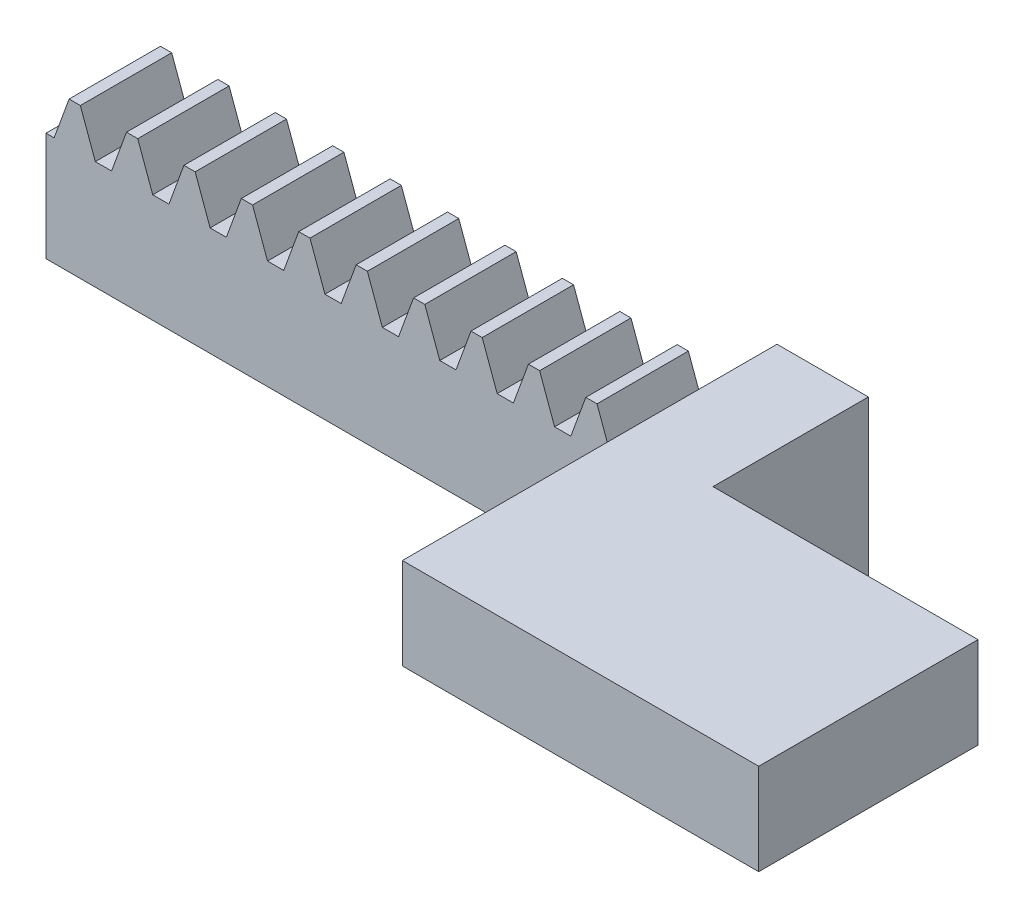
ISO-10303-21;
HEADER;
FILE_DESCRIPTION(('STEP AP214'),'2;1');
FILE_NAME('part.step','',(''),(''),'','','');
FILE_SCHEMA(('AUTOMOTIVE_DESIGN { 1 0 10303 214 1 1 1 1 }'));
ENDSEC;
DATA;
#1=APPLICATION_CONTEXT('core data for automotive mechanical design processes');
#2=APPLICATION_PROTOCOL_DEFINITION('international standard','automotive_design',2000,#1);
#3=PRODUCT_CONTEXT('',#1,'mechanical');
#4=PRODUCT('Part','Part','',(#3));
#5=PRODUCT_RELATED_PRODUCT_CATEGORY('part','',(#4));
#6=PRODUCT_DEFINITION_FORMATION('','',#4);
#7=PRODUCT_DEFINITION_CONTEXT('part definition',#1,'design');
#8=PRODUCT_DEFINITION('design','',#6,#7);
#9=PRODUCT_DEFINITION_SHAPE('','',#8);
#10=(LENGTH_UNIT() NAMED_UNIT(*) SI_UNIT(.MILLI.,.METRE.));
#11=(NAMED_UNIT(*) PLANE_ANGLE_UNIT() SI_UNIT($,.RADIAN.));
#12=(NAMED_UNIT(*) SI_UNIT($,.STERADIAN.) SOLID_ANGLE_UNIT());
#13=UNCERTAINTY_MEASURE_WITH_UNIT(LENGTH_MEASURE(1.E-05),#10,'distance_accuracy_value','');
#14=(GEOMETRIC_REPRESENTATION_CONTEXT(3) GLOBAL_UNCERTAINTY_ASSIGNED_CONTEXT((#13)) GLOBAL_UNIT_ASSIGNED_CONTEXT((#10,
#11,#12)) REPRESENTATION_CONTEXT('',''));
#15=CARTESIAN_POINT('',(0.,0.,0.));
#16=DIRECTION('',(0.,0.,1.));
#17=DIRECTION('',(1.,0.,0.));
#18=AXIS2_PLACEMENT_3D('',#15,#16,#17);
#19=CARTESIAN_POINT('',(0.,8.2,0.));
#20=DIRECTION('',(0.,0.,-1.));
#21=DIRECTION('',(-1.,0.,0.));
#22=AXIS2_PLACEMENT_3D('',#19,#20,#21);
#23=PLANE('',#22);
#24=DIRECTION('',(1.,0.,0.));
#25=VECTOR('',#24,1.);
#26=CARTESIAN_POINT('',(35.0019545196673,5.95,0.));
#27=LINE('',#26,#25);
#28=CARTESIAN_POINT('',(35.0019545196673,5.95,0.));
#29=VERTEX_POINT('',#28);
#30=CARTESIAN_POINT('',(40.,5.95,0.));
#31=VERTEX_POINT('',#30);
#32=EDGE_CURVE('E420',#29,#31,#27,.T.);
#33=ORIENTED_EDGE('',*,*,#32,.F.);
#34=DIRECTION('',(1.,0.,0.));
#35=VECTOR('',#34,1.);
#36=CARTESIAN_POINT('',(35.0019545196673,5.95,0.));
#37=LINE('',#36,#35);
#38=CARTESIAN_POINT('',(34.1130837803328,5.95,0.));
#39=VERTEX_POINT('',#38);
#40=EDGE_CURVE('E382',#39,#29,#37,.T.);
#41=ORIENTED_EDGE('',*,*,#40,.F.);
#42=DIRECTION('',(-0.342020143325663,0.939692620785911,0.));
#43=VECTOR('',#42,1.);
#44=CARTESIAN_POINT('',(29.3994749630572,18.9005337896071,0.));
#45=LINE('',#44,#43);
#46=CARTESIAN_POINT('',(33.2941507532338,8.2,0.));
#47=VERTEX_POINT('',#46);
#48=EDGE_CURVE('E11',#39,#47,#45,.T.);
#49=ORIENTED_EDGE('',*,*,#48,.T.);
#50=DIRECTION('',(-1.,0.,0.));
#51=VECTOR('',#50,1.);
#52=CARTESIAN_POINT('',(0.,8.2,0.));
#53=LINE('',#52,#51);
#54=CARTESIAN_POINT('',(32.6792948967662,8.2,0.));
#55=VERTEX_POINT('',#54);
#56=EDGE_CURVE('E701',#47,#55,#53,.T.);
#57=ORIENTED_EDGE('',*,*,#56,.T.);
#58=DIRECTION('',(0.342020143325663,0.939692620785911,0.));
#59=VECTOR('',#58,1.);
#60=CARTESIAN_POINT('',(32.6885397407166,8.2254,0.));
#61=LINE('',#60,#59);
#62=CARTESIAN_POINT('',(31.8603618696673,5.95,0.));
#63=VERTEX_POINT('',#62);
#64=EDGE_CURVE('E445',#63,#55,#61,.T.);
#65=ORIENTED_EDGE('',*,*,#64,.F.);
#66=DIRECTION('',(1.,0.,0.));
#67=VECTOR('',#66,1.);
#68=CARTESIAN_POINT('',(31.8603618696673,5.95,0.));
#69=LINE('',#68,#67);
#70=CARTESIAN_POINT('',(30.9714911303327,5.95,0.));
#71=VERTEX_POINT('',#70);
#72=EDGE_CURVE('E440',#71,#63,#69,.T.);
#73=ORIENTED_EDGE('',*,*,#72,.F.);
#74=DIRECTION('',(-0.342020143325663,0.939692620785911,0.));
#75=VECTOR('',#74,1.);
#76=CARTESIAN_POINT('',(26.6253788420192,17.8908453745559,0.));
#77=LINE('',#76,#75);
#78=CARTESIAN_POINT('',(30.1525581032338,8.2,0.));
#79=VERTEX_POINT('',#78);
#80=EDGE_CURVE('E42',#71,#79,#77,.T.);
#81=ORIENTED_EDGE('',*,*,#80,.T.);
#82=CARTESIAN_POINT('',(29.5377022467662,8.2,0.));
#83=VERTEX_POINT('',#82);
#84=EDGE_CURVE('E719',#79,#83,#53,.T.);
#85=ORIENTED_EDGE('',*,*,#84,.T.);
#86=DIRECTION('',(0.342020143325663,0.939692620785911,0.));
#87=VECTOR('',#86,1.);
#88=CARTESIAN_POINT('',(29.5469470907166,8.2254,0.));
#89=LINE('',#88,#87);
#90=CARTESIAN_POINT('',(28.7187692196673,5.95,0.));
#91=VERTEX_POINT('',#90);
#92=EDGE_CURVE('E469',#91,#83,#89,.T.);
#93=ORIENTED_EDGE('',*,*,#92,.F.);
#94=DIRECTION('',(1.,0.,0.));
#95=VECTOR('',#94,1.);
#96=CARTESIAN_POINT('',(28.7187692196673,5.95,0.));
#97=LINE('',#96,#95);
#98=CARTESIAN_POINT('',(27.8298984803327,5.95,0.));
#99=VERTEX_POINT('',#98);
#100=EDGE_CURVE('E464',#99,#91,#97,.T.);
#101=ORIENTED_EDGE('',*,*,#100,.F.);
#102=DIRECTION('',(-0.342020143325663,0.939692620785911,0.));
#103=VECTOR('',#102,1.);
#104=CARTESIAN_POINT('',(23.8512827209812,16.8811569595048,0.));
#105=LINE('',#104,#103);
#106=CARTESIAN_POINT('',(27.0109654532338,8.2,0.));
#107=VERTEX_POINT('',#106);
#108=EDGE_CURVE('E751',#99,#107,#105,.T.);
#109=ORIENTED_EDGE('',*,*,#108,.T.);
#110=CARTESIAN_POINT('',(26.3961095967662,8.2,0.));
#111=VERTEX_POINT('',#110);
#112=EDGE_CURVE('E767',#107,#111,#53,.T.);
#113=ORIENTED_EDGE('',*,*,#112,.T.);
#114=DIRECTION('',(0.342020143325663,0.939692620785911,0.));
#115=VECTOR('',#114,1.);
#116=CARTESIAN_POINT('',(26.4053544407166,8.2254,0.));
#117=LINE('',#116,#115);
#118=CARTESIAN_POINT('',(25.5771765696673,5.95,0.));
#119=VERTEX_POINT('',#118);
#120=EDGE_CURVE('E493',#119,#111,#117,.T.);
#121=ORIENTED_EDGE('',*,*,#120,.F.);
#122=DIRECTION('',(1.,0.,0.));
#123=VECTOR('',#122,1.);
#124=CARTESIAN_POINT('',(25.5771765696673,5.95,0.));
#125=LINE('',#124,#123);
#126=CARTESIAN_POINT('',(24.6883058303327,5.95,0.));
#127=VERTEX_POINT('',#126);
#128=EDGE_CURVE('E488',#127,#119,#125,.T.);
#129=ORIENTED_EDGE('',*,*,#128,.F.);
#130=DIRECTION('',(-0.342020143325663,0.939692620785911,0.));
#131=VECTOR('',#130,1.);
#132=CARTESIAN_POINT('',(21.0771865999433,15.8714685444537,0.));
#133=LINE('',#132,#131);
#134=CARTESIAN_POINT('',(23.8693728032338,8.2,0.));
#135=VERTEX_POINT('',#134);
#136=EDGE_CURVE('E748',#127,#135,#133,.T.);
#137=ORIENTED_EDGE('',*,*,#136,.T.);
#138=CARTESIAN_POINT('',(23.2545169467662,8.2,0.));
#139=VERTEX_POINT('',#138);
#140=EDGE_CURVE('E768',#135,#139,#53,.T.);
#141=ORIENTED_EDGE('',*,*,#140,.T.);
#142=DIRECTION('',(0.342020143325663,0.939692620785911,0.));
#143=VECTOR('',#142,1.);
#144=CARTESIAN_POINT('',(23.2637617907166,8.2254,0.));
#145=LINE('',#144,#143);
#146=CARTESIAN_POINT('',(22.4355839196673,5.95,0.));
#147=VERTEX_POINT('',#146);
#148=EDGE_CURVE('E517',#147,#139,#145,.T.);
#149=ORIENTED_EDGE('',*,*,#148,.F.);
#150=DIRECTION('',(1.,0.,0.));
#151=VECTOR('',#150,1.);
#152=CARTESIAN_POINT('',(22.4355839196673,5.95,0.));
#153=LINE('',#152,#151);
#154=CARTESIAN_POINT('',(21.5467131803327,5.95,0.));
#155=VERTEX_POINT('',#154);
#156=EDGE_CURVE('E512',#155,#147,#153,.T.);
#157=ORIENTED_EDGE('',*,*,#156,.F.);
#158=DIRECTION('',(-0.342020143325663,0.939692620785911,0.));
#159=VECTOR('',#158,1.);
#160=CARTESIAN_POINT('',(18.3030904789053,14.8617801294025,0.));
#161=LINE('',#160,#159);
#162=CARTESIAN_POINT('',(20.7277801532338,8.2,0.));
#163=VERTEX_POINT('',#162);
#164=EDGE_CURVE('E745',#155,#163,#161,.T.);
#165=ORIENTED_EDGE('',*,*,#164,.T.);
#166=CARTESIAN_POINT('',(20.1129242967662,8.2,0.));
#167=VERTEX_POINT('',#166);
#168=EDGE_CURVE('E771',#163,#167,#53,.T.);
#169=ORIENTED_EDGE('',*,*,#168,.T.);
#170=DIRECTION('',(0.342020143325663,0.939692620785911,0.));
#171=VECTOR('',#170,1.);
#172=CARTESIAN_POINT('',(20.1221691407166,8.2254,0.));
#173=LINE('',#172,#171);
#174=CARTESIAN_POINT('',(19.2939912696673,5.95,0.));
#175=VERTEX_POINT('',#174);
#176=EDGE_CURVE('E541',#175,#167,#173,.T.);
#177=ORIENTED_EDGE('',*,*,#176,.F.);
#178=DIRECTION('',(1.,0.,0.));
#179=VECTOR('',#178,1.);
#180=CARTESIAN_POINT('',(19.2939912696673,5.95,0.));
#181=LINE('',#180,#179);
#182=CARTESIAN_POINT('',(18.4051205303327,5.95,0.));
#183=VERTEX_POINT('',#182);
#184=EDGE_CURVE('E536',#183,#175,#181,.T.);
#185=ORIENTED_EDGE('',*,*,#184,.F.);
#186=DIRECTION('',(-0.342020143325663,0.939692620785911,0.));
#187=VECTOR('',#186,1.);
#188=CARTESIAN_POINT('',(15.5289943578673,13.8520917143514,0.));
#189=LINE('',#188,#187);
#190=CARTESIAN_POINT('',(17.5861875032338,8.2,0.));
#191=VERTEX_POINT('',#190);
#192=EDGE_CURVE('E742',#183,#191,#189,.T.);
#193=ORIENTED_EDGE('',*,*,#192,.T.);
#194=CARTESIAN_POINT('',(16.9713316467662,8.2,0.));
#195=VERTEX_POINT('',#194);
#196=EDGE_CURVE('E774',#191,#195,#53,.T.);
#197=ORIENTED_EDGE('',*,*,#196,.T.);
#198=DIRECTION('',(0.342020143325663,0.939692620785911,0.));
#199=VECTOR('',#198,1.);
#200=CARTESIAN_POINT('',(16.9805764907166,8.2254,0.));
#201=LINE('',#200,#199);
#202=CARTESIAN_POINT('',(16.1523986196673,5.95,0.));
#203=VERTEX_POINT('',#202);
#204=EDGE_CURVE('E565',#203,#195,#201,.T.);
#205=ORIENTED_EDGE('',*,*,#204,.F.);
#206=DIRECTION('',(1.,0.,0.));
#207=VECTOR('',#206,1.);
#208=CARTESIAN_POINT('',(16.1523986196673,5.95,0.));
#209=LINE('',#208,#207);
#210=CARTESIAN_POINT('',(15.2635278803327,5.95,0.));
#211=VERTEX_POINT('',#210);
#212=EDGE_CURVE('E560',#211,#203,#209,.T.);
#213=ORIENTED_EDGE('',*,*,#212,.F.);
#214=DIRECTION('',(-0.342020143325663,0.939692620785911,0.));
#215=VECTOR('',#214,1.);
#216=CARTESIAN_POINT('',(12.7548982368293,12.8424032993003,0.));
#217=LINE('',#216,#215);
#218=CARTESIAN_POINT('',(14.4445948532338,8.2,0.));
#219=VERTEX_POINT('',#218);
#220=EDGE_CURVE('E739',#211,#219,#217,.T.);
#221=ORIENTED_EDGE('',*,*,#220,.T.);
#222=CARTESIAN_POINT('',(13.8297389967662,8.2,0.));
#223=VERTEX_POINT('',#222);
#224=EDGE_CURVE('E777',#219,#223,#53,.T.);
#225=ORIENTED_EDGE('',*,*,#224,.T.);
#226=DIRECTION('',(0.342020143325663,0.939692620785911,0.));
#227=VECTOR('',#226,1.);
#228=CARTESIAN_POINT('',(13.8389838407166,8.2254,0.));
#229=LINE('',#228,#227);
#230=CARTESIAN_POINT('',(13.0108059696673,5.95,0.));
#231=VERTEX_POINT('',#230);
#232=EDGE_CURVE('E589',#231,#223,#229,.T.);
#233=ORIENTED_EDGE('',*,*,#232,.F.);
#234=DIRECTION('',(1.,0.,0.));
#235=VECTOR('',#234,1.);
#236=CARTESIAN_POINT('',(13.0108059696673,5.95,0.));
#237=LINE('',#236,#235);
#238=CARTESIAN_POINT('',(12.1219352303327,5.95,0.));
#239=VERTEX_POINT('',#238);
#240=EDGE_CURVE('E584',#239,#231,#237,.T.);
#241=ORIENTED_EDGE('',*,*,#240,.F.);
#242=DIRECTION('',(-0.342020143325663,0.939692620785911,0.));
#243=VECTOR('',#242,1.);
#244=CARTESIAN_POINT('',(9.98080211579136,11.8327148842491,0.));
#245=LINE('',#244,#243);
#246=CARTESIAN_POINT('',(11.3030022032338,8.2,0.));
#247=VERTEX_POINT('',#246);
#248=EDGE_CURVE('E736',#239,#247,#245,.T.);
#249=ORIENTED_EDGE('',*,*,#248,.T.);
#250=CARTESIAN_POINT('',(10.6881463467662,8.2,0.));
#251=VERTEX_POINT('',#250);
#252=EDGE_CURVE('E780',#247,#251,#53,.T.);
#253=ORIENTED_EDGE('',*,*,#252,.T.);
#254=DIRECTION('',(0.342020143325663,0.939692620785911,0.));
#255=VECTOR('',#254,1.);
#256=CARTESIAN_POINT('',(10.6973911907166,8.2254,0.));
#257=LINE('',#256,#255);
#258=CARTESIAN_POINT('',(9.86921331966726,5.95,0.));
#259=VERTEX_POINT('',#258);
#260=EDGE_CURVE('E613',#259,#251,#257,.T.);
#261=ORIENTED_EDGE('',*,*,#260,.F.);
#262=DIRECTION('',(1.,0.,0.));
#263=VECTOR('',#262,1.);
#264=CARTESIAN_POINT('',(9.86921331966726,5.95,0.));
#265=LINE('',#264,#263);
#266=CARTESIAN_POINT('',(8.98034258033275,5.95,0.));
#267=VERTEX_POINT('',#266);
#268=EDGE_CURVE('E608',#267,#259,#265,.T.);
#269=ORIENTED_EDGE('',*,*,#268,.F.);
#270=DIRECTION('',(-0.342020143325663,0.939692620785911,0.));
#271=VECTOR('',#270,1.);
#272=CARTESIAN_POINT('',(7.20670599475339,10.823026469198,0.));
#273=LINE('',#272,#271);
#274=CARTESIAN_POINT('',(8.16140955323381,8.2,0.));
#275=VERTEX_POINT('',#274);
#276=EDGE_CURVE('E733',#267,#275,#273,.T.);
#277=ORIENTED_EDGE('',*,*,#276,.T.);
#278=CARTESIAN_POINT('',(7.5465536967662,8.2,0.));
#279=VERTEX_POINT('',#278);
#280=EDGE_CURVE('E783',#275,#279,#53,.T.);
#281=ORIENTED_EDGE('',*,*,#280,.T.);
#282=DIRECTION('',(0.342020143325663,0.939692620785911,0.));
#283=VECTOR('',#282,1.);
#284=CARTESIAN_POINT('',(7.55579854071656,8.2254,0.));
#285=LINE('',#284,#283);
#286=CARTESIAN_POINT('',(6.72762066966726,5.95,0.));
#287=VERTEX_POINT('',#286);
#288=EDGE_CURVE('E637',#287,#279,#285,.T.);
#289=ORIENTED_EDGE('',*,*,#288,.F.);
#290=DIRECTION('',(1.,0.,0.));
#291=VECTOR('',#290,1.);
#292=CARTESIAN_POINT('',(6.72762066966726,5.95,0.));
#293=LINE('',#292,#291);
#294=CARTESIAN_POINT('',(5.83874993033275,5.95,0.));
#295=VERTEX_POINT('',#294);
#296=EDGE_CURVE('E632',#295,#287,#293,.T.);
#297=ORIENTED_EDGE('',*,*,#296,.F.);
#298=DIRECTION('',(-0.342020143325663,0.939692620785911,0.));
#299=VECTOR('',#298,1.);
#300=CARTESIAN_POINT('',(4.43260987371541,9.81333805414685,0.));
#301=LINE('',#300,#299);
#302=CARTESIAN_POINT('',(5.01981690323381,8.2,0.));
#303=VERTEX_POINT('',#302);
#304=EDGE_CURVE('E730',#295,#303,#301,.T.);
#305=ORIENTED_EDGE('',*,*,#304,.T.);
#306=CARTESIAN_POINT('',(4.40496104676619,8.2,0.));
#307=VERTEX_POINT('',#306);
#308=EDGE_CURVE('E786',#303,#307,#53,.T.);
#309=ORIENTED_EDGE('',*,*,#308,.T.);
#310=DIRECTION('',(0.342020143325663,0.939692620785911,0.));
#311=VECTOR('',#310,1.);
#312=CARTESIAN_POINT('',(4.41420589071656,8.2254,0.));
#313=LINE('',#312,#311);
#314=CARTESIAN_POINT('',(3.58602801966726,5.95,0.));
#315=VERTEX_POINT('',#314);
#316=EDGE_CURVE('E661',#315,#307,#313,.T.);
#317=ORIENTED_EDGE('',*,*,#316,.F.);
#318=DIRECTION('',(1.,0.,0.));
#319=VECTOR('',#318,1.);
#320=CARTESIAN_POINT('',(3.58602801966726,5.95,0.));
#321=LINE('',#320,#319);
#322=CARTESIAN_POINT('',(2.69715728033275,5.95,0.));
#323=VERTEX_POINT('',#322);
#324=EDGE_CURVE('E656',#323,#315,#321,.T.);
#325=ORIENTED_EDGE('',*,*,#324,.F.);
#326=DIRECTION('',(-0.342020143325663,0.939692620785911,0.));
#327=VECTOR('',#326,1.);
#328=CARTESIAN_POINT('',(1.65851375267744,8.80364963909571,0.));
#329=LINE('',#328,#327);
#330=CARTESIAN_POINT('',(1.87822425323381,8.2,0.));
#331=VERTEX_POINT('',#330);
#332=EDGE_CURVE('E727',#323,#331,#329,.T.);
#333=ORIENTED_EDGE('',*,*,#332,.T.);
#334=CARTESIAN_POINT('',(1.26336839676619,8.2,0.));
#335=VERTEX_POINT('',#334);
#336=EDGE_CURVE('E717',#331,#335,#53,.T.);
#337=ORIENTED_EDGE('',*,*,#336,.T.);
#338=DIRECTION('',(0.342020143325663,0.939692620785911,0.));
#339=VECTOR('',#338,1.);
#340=CARTESIAN_POINT('',(1.27261324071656,8.2254,0.));
#341=LINE('',#340,#339);
#342=CARTESIAN_POINT('',(0.444435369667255,5.95,0.));
#343=VERTEX_POINT('',#342);
#344=EDGE_CURVE('E680',#343,#335,#341,.T.);
#345=ORIENTED_EDGE('',*,*,#344,.F.);
#346=DIRECTION('',(-1.,0.,0.));
#347=VECTOR('',#346,1.);
#348=CARTESIAN_POINT('',(0.,5.95,0.));
#349=LINE('',#348,#347);
#350=CARTESIAN_POINT('',(0.,5.95,0.));
#351=VERTEX_POINT('',#350);
#352=EDGE_CURVE('E722',#343,#351,#349,.T.);
#353=ORIENTED_EDGE('',*,*,#352,.T.);
#354=DIRECTION('',(0.,-1.,0.));
#355=VECTOR('',#354,1.);
#356=CARTESIAN_POINT('',(0.,0.,0.));
#357=LINE('',#356,#355);
#358=CARTESIAN_POINT('',(0.,0.,0.));
#359=VERTEX_POINT('',#358);
#360=EDGE_CURVE('E697',#351,#359,#357,.T.);
#361=ORIENTED_EDGE('',*,*,#360,.T.);
#362=DIRECTION('',(1.,0.,0.));
#363=VECTOR('',#362,1.);
#364=CARTESIAN_POINT('',(0.,0.,0.));
#365=LINE('',#364,#363);
#366=CARTESIAN_POINT('',(40.,0.,0.));
#367=VERTEX_POINT('',#366);
#368=EDGE_CURVE('E712',#359,#367,#365,.T.);
#369=ORIENTED_EDGE('',*,*,#368,.T.);
#370=DIRECTION('',(0.,1.,0.));
#371=VECTOR('',#370,1.);
#372=CARTESIAN_POINT('',(40.,0.,0.));
#373=LINE('',#372,#371);
#374=EDGE_CURVE('E715',#367,#31,#373,.T.);
#375=ORIENTED_EDGE('',*,*,#374,.T.);
#376=EDGE_LOOP('',(#33,#41,#49,#57,#65,#73,#81,#85,#93,#101,#109,#113,#121,#129,#137,#141,#149,
#157,#165,#169,#177,#185,#193,#197,#205,#213,#221,#225,#233,#241,#249,#253,#261,#269,#277,#281,
#289,#297,#305,#309,#317,#325,#333,#337,#345,#353,#361,#369,#375));
#377=FACE_BOUND('',#376,.T.);
#378=ADVANCED_FACE('F34',(#377),#23,.F.);
#379=CARTESIAN_POINT('',(0.,8.2,-5.));
#380=DIRECTION('',(0.,1.,0.));
#381=DIRECTION('',(0.,0.,1.));
#382=AXIS2_PLACEMENT_3D('',#379,#380,#381);
#383=PLANE('',#382);
#384=DIRECTION('',(0.,0.,1.));
#385=VECTOR('',#384,1.);
#386=CARTESIAN_POINT('',(33.2941507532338,8.2,-5.));
#387=LINE('',#386,#385);
#388=CARTESIAN_POINT('',(33.2941507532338,8.2,-5.));
#389=VERTEX_POINT('',#388);
#390=EDGE_CURVE('E437',#389,#47,#387,.T.);
#391=ORIENTED_EDGE('',*,*,#390,.F.);
#392=DIRECTION('',(-1.,0.,0.));
#393=VECTOR('',#392,1.);
#394=CARTESIAN_POINT('',(0.,8.2,-5.));
#395=LINE('',#394,#393);
#396=CARTESIAN_POINT('',(32.6792948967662,8.2,-5.));
#397=VERTEX_POINT('',#396);
#398=EDGE_CURVE('E707',#389,#397,#395,.T.);
#399=ORIENTED_EDGE('',*,*,#398,.T.);
#400=DIRECTION('',(0.,0.,-1.));
#401=VECTOR('',#400,1.);
#402=CARTESIAN_POINT('',(32.6792948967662,8.2,-5.));
#403=LINE('',#402,#401);
#404=EDGE_CURVE('E458',#55,#397,#403,.T.);
#405=ORIENTED_EDGE('',*,*,#404,.F.);
#406=ORIENTED_EDGE('',*,*,#56,.F.);
#407=EDGE_LOOP('',(#391,#399,#405,#406));
#408=FACE_BOUND('',#407,.T.);
#409=ADVANCED_FACE('F944',(#408),#383,.T.);
#410=DIRECTION('',(0.,0.,1.));
#411=VECTOR('',#410,1.);
#412=CARTESIAN_POINT('',(30.1525581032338,8.2,-5.));
#413=LINE('',#412,#411);
#414=CARTESIAN_POINT('',(30.1525581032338,8.2,-5.));
#415=VERTEX_POINT('',#414);
#416=EDGE_CURVE('E462',#415,#79,#413,.T.);
#417=ORIENTED_EDGE('',*,*,#416,.F.);
#418=CARTESIAN_POINT('',(29.5377022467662,8.2,-5.));
#419=VERTEX_POINT('',#418);
#420=EDGE_CURVE('E710',#415,#419,#395,.T.);
#421=ORIENTED_EDGE('',*,*,#420,.T.);
#422=DIRECTION('',(0.,0.,-1.));
#423=VECTOR('',#422,1.);
#424=CARTESIAN_POINT('',(29.5377022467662,8.2,-5.));
#425=LINE('',#424,#423);
#426=EDGE_CURVE('E482',#83,#419,#425,.T.);
#427=ORIENTED_EDGE('',*,*,#426,.F.);
#428=ORIENTED_EDGE('',*,*,#84,.F.);
#429=EDGE_LOOP('',(#417,#421,#427,#428));
#430=FACE_BOUND('',#429,.T.);
#431=ADVANCED_FACE('F765',(#430),#383,.T.);
#432=DIRECTION('',(0.,0.,1.));
#433=VECTOR('',#432,1.);
#434=CARTESIAN_POINT('',(27.0109654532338,8.2,-5.));
#435=LINE('',#434,#433);
#436=CARTESIAN_POINT('',(27.0109654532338,8.2,-5.));
#437=VERTEX_POINT('',#436);
#438=EDGE_CURVE('E486',#437,#107,#435,.T.);
#439=ORIENTED_EDGE('',*,*,#438,.F.);
#440=CARTESIAN_POINT('',(26.3961095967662,8.2,-5.));
#441=VERTEX_POINT('',#440);
#442=EDGE_CURVE('E834',#437,#441,#395,.T.);
#443=ORIENTED_EDGE('',*,*,#442,.T.);
#444=DIRECTION('',(0.,0.,-1.));
#445=VECTOR('',#444,1.);
#446=CARTESIAN_POINT('',(26.3961095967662,8.2,-5.));
#447=LINE('',#446,#445);
#448=EDGE_CURVE('E506',#111,#441,#447,.T.);
#449=ORIENTED_EDGE('',*,*,#448,.F.);
#450=ORIENTED_EDGE('',*,*,#112,.F.);
#451=EDGE_LOOP('',(#439,#443,#449,#450));
#452=FACE_BOUND('',#451,.T.);
#453=ADVANCED_FACE('F852',(#452),#383,.T.);
#454=DIRECTION('',(0.,0.,1.));
#455=VECTOR('',#454,1.);
#456=CARTESIAN_POINT('',(23.8693728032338,8.2,-5.));
#457=LINE('',#456,#455);
#458=CARTESIAN_POINT('',(23.8693728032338,8.2,-5.));
#459=VERTEX_POINT('',#458);
#460=EDGE_CURVE('E510',#459,#135,#457,.T.);
#461=ORIENTED_EDGE('',*,*,#460,.F.);
#462=CARTESIAN_POINT('',(23.2545169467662,8.2,-5.));
#463=VERTEX_POINT('',#462);
#464=EDGE_CURVE('E829',#459,#463,#395,.T.);
#465=ORIENTED_EDGE('',*,*,#464,.T.);
#466=DIRECTION('',(0.,0.,-1.));
#467=VECTOR('',#466,1.);
#468=CARTESIAN_POINT('',(23.2545169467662,8.2,-5.));
#469=LINE('',#468,#467);
#470=EDGE_CURVE('E530',#139,#463,#469,.T.);
#471=ORIENTED_EDGE('',*,*,#470,.F.);
#472=ORIENTED_EDGE('',*,*,#140,.F.);
#473=EDGE_LOOP('',(#461,#465,#471,#472));
#474=FACE_BOUND('',#473,.T.);
#475=ADVANCED_FACE('F862',(#474),#383,.T.);
#476=DIRECTION('',(0.,0.,1.));
#477=VECTOR('',#476,1.);
#478=CARTESIAN_POINT('',(20.7277801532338,8.2,-5.));
#479=LINE('',#478,#477);
#480=CARTESIAN_POINT('',(20.7277801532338,8.2,-5.));
#481=VERTEX_POINT('',#480);
#482=EDGE_CURVE('E534',#481,#163,#479,.T.);
#483=ORIENTED_EDGE('',*,*,#482,.F.);
#484=CARTESIAN_POINT('',(20.1129242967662,8.2,-5.));
#485=VERTEX_POINT('',#484);
#486=EDGE_CURVE('E824',#481,#485,#395,.T.);
#487=ORIENTED_EDGE('',*,*,#486,.T.);
#488=DIRECTION('',(0.,0.,-1.));
#489=VECTOR('',#488,1.);
#490=CARTESIAN_POINT('',(20.1129242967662,8.2,-5.));
#491=LINE('',#490,#489);
#492=EDGE_CURVE('E554',#167,#485,#491,.T.);
#493=ORIENTED_EDGE('',*,*,#492,.F.);
#494=ORIENTED_EDGE('',*,*,#168,.F.);
#495=EDGE_LOOP('',(#483,#487,#493,#494));
#496=FACE_BOUND('',#495,.T.);
#497=ADVANCED_FACE('F872',(#496),#383,.T.);
#498=DIRECTION('',(0.,0.,1.));
#499=VECTOR('',#498,1.);
#500=CARTESIAN_POINT('',(17.5861875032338,8.2,-5.));
#501=LINE('',#500,#499);
#502=CARTESIAN_POINT('',(17.5861875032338,8.2,-5.));
#503=VERTEX_POINT('',#502);
#504=EDGE_CURVE('E558',#503,#191,#501,.T.);
#505=ORIENTED_EDGE('',*,*,#504,.F.);
#506=CARTESIAN_POINT('',(16.9713316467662,8.2,-5.));
#507=VERTEX_POINT('',#506);
#508=EDGE_CURVE('E819',#503,#507,#395,.T.);
#509=ORIENTED_EDGE('',*,*,#508,.T.);
#510=DIRECTION('',(0.,0.,-1.));
#511=VECTOR('',#510,1.);
#512=CARTESIAN_POINT('',(16.9713316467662,8.2,-5.));
#513=LINE('',#512,#511);
#514=EDGE_CURVE('E578',#195,#507,#513,.T.);
#515=ORIENTED_EDGE('',*,*,#514,.F.);
#516=ORIENTED_EDGE('',*,*,#196,.F.);
#517=EDGE_LOOP('',(#505,#509,#515,#516));
#518=FACE_BOUND('',#517,.T.);
#519=ADVANCED_FACE('F882',(#518),#383,.T.);
#520=DIRECTION('',(0.,0.,1.));
#521=VECTOR('',#520,1.);
#522=CARTESIAN_POINT('',(14.4445948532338,8.2,-5.));
#523=LINE('',#522,#521);
#524=CARTESIAN_POINT('',(14.4445948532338,8.2,-5.));
#525=VERTEX_POINT('',#524);
#526=EDGE_CURVE('E582',#525,#219,#523,.T.);
#527=ORIENTED_EDGE('',*,*,#526,.F.);
#528=CARTESIAN_POINT('',(13.8297389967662,8.2,-5.));
#529=VERTEX_POINT('',#528);
#530=EDGE_CURVE('E814',#525,#529,#395,.T.);
#531=ORIENTED_EDGE('',*,*,#530,.T.);
#532=DIRECTION('',(0.,0.,-1.));
#533=VECTOR('',#532,1.);
#534=CARTESIAN_POINT('',(13.8297389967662,8.2,-5.));
#535=LINE('',#534,#533);
#536=EDGE_CURVE('E602',#223,#529,#535,.T.);
#537=ORIENTED_EDGE('',*,*,#536,.F.);
#538=ORIENTED_EDGE('',*,*,#224,.F.);
#539=EDGE_LOOP('',(#527,#531,#537,#538));
#540=FACE_BOUND('',#539,.T.);
#541=ADVANCED_FACE('F892',(#540),#383,.T.);
#542=DIRECTION('',(0.,0.,1.));
#543=VECTOR('',#542,1.);
#544=CARTESIAN_POINT('',(11.3030022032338,8.2,-5.));
#545=LINE('',#544,#543);
#546=CARTESIAN_POINT('',(11.3030022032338,8.2,-5.));
#547=VERTEX_POINT('',#546);
#548=EDGE_CURVE('E606',#547,#247,#545,.T.);
#549=ORIENTED_EDGE('',*,*,#548,.F.);
#550=CARTESIAN_POINT('',(10.6881463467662,8.2,-5.));
#551=VERTEX_POINT('',#550);
#552=EDGE_CURVE('E809',#547,#551,#395,.T.);
#553=ORIENTED_EDGE('',*,*,#552,.T.);
#554=DIRECTION('',(0.,0.,-1.));
#555=VECTOR('',#554,1.);
#556=CARTESIAN_POINT('',(10.6881463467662,8.2,-5.));
#557=LINE('',#556,#555);
#558=EDGE_CURVE('E626',#251,#551,#557,.T.);
#559=ORIENTED_EDGE('',*,*,#558,.F.);
#560=ORIENTED_EDGE('',*,*,#252,.F.);
#561=EDGE_LOOP('',(#549,#553,#559,#560));
#562=FACE_BOUND('',#561,.T.);
#563=ADVANCED_FACE('F902',(#562),#383,.T.);
#564=DIRECTION('',(0.,0.,1.));
#565=VECTOR('',#564,1.);
#566=CARTESIAN_POINT('',(8.16140955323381,8.2,-5.));
#567=LINE('',#566,#565);
#568=CARTESIAN_POINT('',(8.16140955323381,8.2,-5.));
#569=VERTEX_POINT('',#568);
#570=EDGE_CURVE('E630',#569,#275,#567,.T.);
#571=ORIENTED_EDGE('',*,*,#570,.F.);
#572=CARTESIAN_POINT('',(7.5465536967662,8.2,-5.));
#573=VERTEX_POINT('',#572);
#574=EDGE_CURVE('E804',#569,#573,#395,.T.);
#575=ORIENTED_EDGE('',*,*,#574,.T.);
#576=DIRECTION('',(0.,0.,-1.));
#577=VECTOR('',#576,1.);
#578=CARTESIAN_POINT('',(7.5465536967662,8.2,-5.));
#579=LINE('',#578,#577);
#580=EDGE_CURVE('E650',#279,#573,#579,.T.);
#581=ORIENTED_EDGE('',*,*,#580,.F.);
#582=ORIENTED_EDGE('',*,*,#280,.F.);
#583=EDGE_LOOP('',(#571,#575,#581,#582));
#584=FACE_BOUND('',#583,.T.);
#585=ADVANCED_FACE('F912',(#584),#383,.T.);
#586=DIRECTION('',(0.,0.,1.));
#587=VECTOR('',#586,1.);
#588=CARTESIAN_POINT('',(5.01981690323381,8.2,-5.));
#589=LINE('',#588,#587);
#590=CARTESIAN_POINT('',(5.01981690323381,8.2,-5.));
#591=VERTEX_POINT('',#590);
#592=EDGE_CURVE('E654',#591,#303,#589,.T.);
#593=ORIENTED_EDGE('',*,*,#592,.F.);
#594=CARTESIAN_POINT('',(4.40496104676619,8.2,-5.));
#595=VERTEX_POINT('',#594);
#596=EDGE_CURVE('E803',#591,#595,#395,.T.);
#597=ORIENTED_EDGE('',*,*,#596,.T.);
#598=DIRECTION('',(0.,0.,-1.));
#599=VECTOR('',#598,1.);
#600=CARTESIAN_POINT('',(4.40496104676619,8.2,-5.));
#601=LINE('',#600,#599);
#602=EDGE_CURVE('E674',#307,#595,#601,.T.);
#603=ORIENTED_EDGE('',*,*,#602,.F.);
#604=ORIENTED_EDGE('',*,*,#308,.F.);
#605=EDGE_LOOP('',(#593,#597,#603,#604));
#606=FACE_BOUND('',#605,.T.);
#607=ADVANCED_FACE('F922',(#606),#383,.T.);
#608=DIRECTION('',(0.,0.,1.));
#609=VECTOR('',#608,1.);
#610=CARTESIAN_POINT('',(1.87822425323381,8.2,-5.));
#611=LINE('',#610,#609);
#612=CARTESIAN_POINT('',(1.87822425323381,8.2,-5.));
#613=VERTEX_POINT('',#612);
#614=EDGE_CURVE('E678',#613,#331,#611,.T.);
#615=ORIENTED_EDGE('',*,*,#614,.F.);
#616=CARTESIAN_POINT('',(1.26336839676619,8.2,-5.));
#617=VERTEX_POINT('',#616);
#618=EDGE_CURVE('E706',#613,#617,#395,.T.);
#619=ORIENTED_EDGE('',*,*,#618,.T.);
#620=DIRECTION('',(0.,0.,-1.));
#621=VECTOR('',#620,1.);
#622=CARTESIAN_POINT('',(1.26336839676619,8.2,-5.));
#623=LINE('',#622,#621);
#624=EDGE_CURVE('E694',#335,#617,#623,.T.);
#625=ORIENTED_EDGE('',*,*,#624,.F.);
#626=ORIENTED_EDGE('',*,*,#336,.F.);
#627=EDGE_LOOP('',(#615,#619,#625,#626));
#628=FACE_BOUND('',#627,.T.);
#629=ADVANCED_FACE('F801',(#628),#383,.T.);
#630=CARTESIAN_POINT('',(0.,0.,-5.));
#631=DIRECTION('',(-1.,0.,0.));
#632=DIRECTION('',(0.,0.,1.));
#633=AXIS2_PLACEMENT_3D('',#630,#631,#632);
#634=PLANE('',#633);
#635=DIRECTION('',(0.,0.,1.));
#636=VECTOR('',#635,1.);
#637=CARTESIAN_POINT('',(0.,5.95,-5.));
#638=LINE('',#637,#636);
#639=CARTESIAN_POINT('',(0.,5.95,-5.));
#640=VERTEX_POINT('',#639);
#641=EDGE_CURVE('E692',#640,#351,#638,.T.);
#642=ORIENTED_EDGE('',*,*,#641,.F.);
#643=DIRECTION('',(0.,-1.,0.));
#644=VECTOR('',#643,1.);
#645=CARTESIAN_POINT('',(0.,0.,-5.));
#646=LINE('',#645,#644);
#647=CARTESIAN_POINT('',(0.,0.,-5.));
#648=VERTEX_POINT('',#647);
#649=EDGE_CURVE('E698',#640,#648,#646,.T.);
#650=ORIENTED_EDGE('',*,*,#649,.T.);
#651=DIRECTION('',(0.,0.,1.));
#652=VECTOR('',#651,1.);
#653=CARTESIAN_POINT('',(0.,0.,-5.));
#654=LINE('',#653,#652);
#655=EDGE_CURVE('E709',#648,#359,#654,.T.);
#656=ORIENTED_EDGE('',*,*,#655,.T.);
#657=ORIENTED_EDGE('',*,*,#360,.F.);
#658=EDGE_LOOP('',(#642,#650,#656,#657));
#659=FACE_BOUND('',#658,.T.);
#660=ADVANCED_FACE('F36',(#659),#634,.T.);
#661=CARTESIAN_POINT('',(40.,0.,-5.));
#662=DIRECTION('',(1.,0.,0.));
#663=DIRECTION('',(0.,0.,-1.));
#664=AXIS2_PLACEMENT_3D('',#661,#662,#663);
#665=PLANE('',#664);
#666=DIRECTION('',(0.,1.,0.));
#667=VECTOR('',#666,1.);
#668=CARTESIAN_POINT('',(40.,8.2,3.5));
#669=LINE('',#668,#667);
#670=CARTESIAN_POINT('',(40.,5.95,3.5));
#671=VERTEX_POINT('',#670);
#672=CARTESIAN_POINT('',(40.,10.95,3.5));
#673=VERTEX_POINT('',#672);
#674=EDGE_CURVE('E49',#671,#673,#669,.T.);
#675=ORIENTED_EDGE('',*,*,#674,.F.);
#676=DIRECTION('',(0.,0.,-1.));
#677=VECTOR('',#676,1.);
#678=CARTESIAN_POINT('',(40.,5.95,15.5));
#679=LINE('',#678,#677);
#680=EDGE_CURVE('E53',#671,#31,#679,.T.);
#681=ORIENTED_EDGE('',*,*,#680,.T.);
#682=ORIENTED_EDGE('',*,*,#374,.F.);
#683=DIRECTION('',(0.,0.,1.));
#684=VECTOR('',#683,1.);
#685=CARTESIAN_POINT('',(40.,0.,-5.));
#686=LINE('',#685,#684);
#687=CARTESIAN_POINT('',(40.,0.,-5.));
#688=VERTEX_POINT('',#687);
#689=EDGE_CURVE('E720',#688,#367,#686,.T.);
#690=ORIENTED_EDGE('',*,*,#689,.F.);
#691=DIRECTION('',(0.,1.,0.));
#692=VECTOR('',#691,1.);
#693=CARTESIAN_POINT('',(40.,0.,-5.));
#694=LINE('',#693,#692);
#695=CARTESIAN_POINT('',(40.,10.95,-5.));
#696=VERTEX_POINT('',#695);
#697=EDGE_CURVE('E704',#688,#696,#694,.T.);
#698=ORIENTED_EDGE('',*,*,#697,.T.);
#699=DIRECTION('',(0.,0.,-1.));
#700=VECTOR('',#699,1.);
#701=CARTESIAN_POINT('',(40.,10.95,3.5));
#702=LINE('',#701,#700);
#703=EDGE_CURVE('E399',#673,#696,#702,.T.);
#704=ORIENTED_EDGE('',*,*,#703,.F.);
#705=EDGE_LOOP('',(#675,#681,#682,#690,#698,#704));
#706=FACE_BOUND('',#705,.T.);
#707=ADVANCED_FACE('F953',(#706),#665,.T.);
#708=CARTESIAN_POINT('',(0.,0.,-5.));
#709=DIRECTION('',(0.,-1.,0.));
#710=DIRECTION('',(0.,0.,-1.));
#711=AXIS2_PLACEMENT_3D('',#708,#709,#710);
#712=PLANE('',#711);
#713=ORIENTED_EDGE('',*,*,#368,.F.);
#714=ORIENTED_EDGE('',*,*,#655,.F.);
#715=DIRECTION('',(1.,0.,0.));
#716=VECTOR('',#715,1.);
#717=CARTESIAN_POINT('',(0.,0.,-5.));
#718=LINE('',#717,#716);
#719=EDGE_CURVE('E700',#648,#688,#718,.T.);
#720=ORIENTED_EDGE('',*,*,#719,.T.);
#721=ORIENTED_EDGE('',*,*,#689,.T.);
#722=EDGE_LOOP('',(#713,#714,#720,#721));
#723=FACE_BOUND('',#722,.T.);
#724=ADVANCED_FACE('F955',(#723),#712,.T.);
#725=CARTESIAN_POINT('',(0.,8.2,-5.));
#726=DIRECTION('',(0.,0.,-1.));
#727=DIRECTION('',(-1.,0.,0.));
#728=AXIS2_PLACEMENT_3D('',#725,#726,#727);
#729=PLANE('',#728);
#730=DIRECTION('',(1.,0.,0.));
#731=VECTOR('',#730,1.);
#732=CARTESIAN_POINT('',(35.0019545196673,5.95,-5.));
#733=LINE('',#732,#731);
#734=CARTESIAN_POINT('',(34.1130837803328,5.95,-5.));
#735=VERTEX_POINT('',#734);
#736=CARTESIAN_POINT('',(35.0019545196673,5.95,-5.));
#737=VERTEX_POINT('',#736);
#738=EDGE_CURVE('E380',#735,#737,#733,.T.);
#739=ORIENTED_EDGE('',*,*,#738,.T.);
#740=DIRECTION('',(0.,-1.,0.));
#741=VECTOR('',#740,1.);
#742=CARTESIAN_POINT('',(35.0019545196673,8.2,-5.));
#743=LINE('',#742,#741);
#744=CARTESIAN_POINT('',(35.0019545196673,10.95,-5.));
#745=VERTEX_POINT('',#744);
#746=EDGE_CURVE('E372',#745,#737,#743,.T.);
#747=ORIENTED_EDGE('',*,*,#746,.F.);
#748=DIRECTION('',(-1.,0.,0.));
#749=VECTOR('',#748,1.);
#750=CARTESIAN_POINT('',(40.,10.95,-5.));
#751=LINE('',#750,#749);
#752=EDGE_CURVE('E377',#696,#745,#751,.T.);
#753=ORIENTED_EDGE('',*,*,#752,.F.);
#754=ORIENTED_EDGE('',*,*,#697,.F.);
#755=ORIENTED_EDGE('',*,*,#719,.F.);
#756=ORIENTED_EDGE('',*,*,#649,.F.);
#757=DIRECTION('',(1.,0.,0.));
#758=VECTOR('',#757,1.);
#759=CARTESIAN_POINT('',(0.444435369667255,5.95,-5.));
#760=LINE('',#759,#758);
#761=CARTESIAN_POINT('',(0.444435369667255,5.95,-5.));
#762=VERTEX_POINT('',#761);
#763=EDGE_CURVE('E681',#640,#762,#760,.T.);
#764=ORIENTED_EDGE('',*,*,#763,.T.);
#765=DIRECTION('',(0.342020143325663,0.939692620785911,0.));
#766=VECTOR('',#765,1.);
#767=CARTESIAN_POINT('',(1.27261324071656,8.2254,-5.));
#768=LINE('',#767,#766);
#769=EDGE_CURVE('E684',#762,#617,#768,.T.);
#770=ORIENTED_EDGE('',*,*,#769,.T.);
#771=ORIENTED_EDGE('',*,*,#618,.F.);
#772=DIRECTION('',(0.342020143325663,-0.939692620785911,0.));
#773=VECTOR('',#772,1.);
#774=CARTESIAN_POINT('',(1.86897940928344,8.2254,-5.));
#775=LINE('',#774,#773);
#776=CARTESIAN_POINT('',(2.69715728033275,5.95,-5.));
#777=VERTEX_POINT('',#776);
#778=EDGE_CURVE('E657',#613,#777,#775,.T.);
#779=ORIENTED_EDGE('',*,*,#778,.T.);
#780=DIRECTION('',(1.,0.,0.));
#781=VECTOR('',#780,1.);
#782=CARTESIAN_POINT('',(3.58602801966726,5.95,-5.));
#783=LINE('',#782,#781);
#784=CARTESIAN_POINT('',(3.58602801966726,5.95,-5.));
#785=VERTEX_POINT('',#784);
#786=EDGE_CURVE('E660',#777,#785,#783,.T.);
#787=ORIENTED_EDGE('',*,*,#786,.T.);
#788=DIRECTION('',(0.342020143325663,0.939692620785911,0.));
#789=VECTOR('',#788,1.);
#790=CARTESIAN_POINT('',(4.41420589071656,8.2254,-5.));
#791=LINE('',#790,#789);
#792=EDGE_CURVE('E664',#785,#595,#791,.T.);
#793=ORIENTED_EDGE('',*,*,#792,.T.);
#794=ORIENTED_EDGE('',*,*,#596,.F.);
#795=DIRECTION('',(0.342020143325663,-0.939692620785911,0.));
#796=VECTOR('',#795,1.);
#797=CARTESIAN_POINT('',(5.01057205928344,8.2254,-5.));
#798=LINE('',#797,#796);
#799=CARTESIAN_POINT('',(5.83874993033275,5.95,-5.));
#800=VERTEX_POINT('',#799);
#801=EDGE_CURVE('E633',#591,#800,#798,.T.);
#802=ORIENTED_EDGE('',*,*,#801,.T.);
#803=DIRECTION('',(1.,0.,0.));
#804=VECTOR('',#803,1.);
#805=CARTESIAN_POINT('',(6.72762066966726,5.95,-5.));
#806=LINE('',#805,#804);
#807=CARTESIAN_POINT('',(6.72762066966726,5.95,-5.));
#808=VERTEX_POINT('',#807);
#809=EDGE_CURVE('E636',#800,#808,#806,.T.);
#810=ORIENTED_EDGE('',*,*,#809,.T.);
#811=DIRECTION('',(0.342020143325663,0.939692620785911,0.));
#812=VECTOR('',#811,1.);
#813=CARTESIAN_POINT('',(7.55579854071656,8.2254,-5.));
#814=LINE('',#813,#812);
#815=EDGE_CURVE('E640',#808,#573,#814,.T.);
#816=ORIENTED_EDGE('',*,*,#815,.T.);
#817=ORIENTED_EDGE('',*,*,#574,.F.);
#818=DIRECTION('',(0.342020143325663,-0.939692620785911,0.));
#819=VECTOR('',#818,1.);
#820=CARTESIAN_POINT('',(8.15216470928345,8.2254,-5.));
#821=LINE('',#820,#819);
#822=CARTESIAN_POINT('',(8.98034258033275,5.95,-5.));
#823=VERTEX_POINT('',#822);
#824=EDGE_CURVE('E609',#569,#823,#821,.T.);
#825=ORIENTED_EDGE('',*,*,#824,.T.);
#826=DIRECTION('',(1.,0.,0.));
#827=VECTOR('',#826,1.);
#828=CARTESIAN_POINT('',(9.86921331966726,5.95,-5.));
#829=LINE('',#828,#827);
#830=CARTESIAN_POINT('',(9.86921331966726,5.95,-5.));
#831=VERTEX_POINT('',#830);
#832=EDGE_CURVE('E612',#823,#831,#829,.T.);
#833=ORIENTED_EDGE('',*,*,#832,.T.);
#834=DIRECTION('',(0.342020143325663,0.939692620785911,0.));
#835=VECTOR('',#834,1.);
#836=CARTESIAN_POINT('',(10.6973911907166,8.2254,-5.));
#837=LINE('',#836,#835);
#838=EDGE_CURVE('E616',#831,#551,#837,.T.);
#839=ORIENTED_EDGE('',*,*,#838,.T.);
#840=ORIENTED_EDGE('',*,*,#552,.F.);
#841=DIRECTION('',(0.342020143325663,-0.939692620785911,0.));
#842=VECTOR('',#841,1.);
#843=CARTESIAN_POINT('',(11.2937573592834,8.2254,-5.));
#844=LINE('',#843,#842);
#845=CARTESIAN_POINT('',(12.1219352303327,5.95,-5.));
#846=VERTEX_POINT('',#845);
#847=EDGE_CURVE('E585',#547,#846,#844,.T.);
#848=ORIENTED_EDGE('',*,*,#847,.T.);
#849=DIRECTION('',(1.,0.,0.));
#850=VECTOR('',#849,1.);
#851=CARTESIAN_POINT('',(13.0108059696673,5.95,-5.));
#852=LINE('',#851,#850);
#853=CARTESIAN_POINT('',(13.0108059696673,5.95,-5.));
#854=VERTEX_POINT('',#853);
#855=EDGE_CURVE('E588',#846,#854,#852,.T.);
#856=ORIENTED_EDGE('',*,*,#855,.T.);
#857=DIRECTION('',(0.342020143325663,0.939692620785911,0.));
#858=VECTOR('',#857,1.);
#859=CARTESIAN_POINT('',(13.8389838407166,8.2254,-5.));
#860=LINE('',#859,#858);
#861=EDGE_CURVE('E592',#854,#529,#860,.T.);
#862=ORIENTED_EDGE('',*,*,#861,.T.);
#863=ORIENTED_EDGE('',*,*,#530,.F.);
#864=DIRECTION('',(0.342020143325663,-0.939692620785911,0.));
#865=VECTOR('',#864,1.);
#866=CARTESIAN_POINT('',(14.4353500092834,8.2254,-5.));
#867=LINE('',#866,#865);
#868=CARTESIAN_POINT('',(15.2635278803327,5.95,-5.));
#869=VERTEX_POINT('',#868);
#870=EDGE_CURVE('E561',#525,#869,#867,.T.);
#871=ORIENTED_EDGE('',*,*,#870,.T.);
#872=DIRECTION('',(1.,0.,0.));
#873=VECTOR('',#872,1.);
#874=CARTESIAN_POINT('',(16.1523986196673,5.95,-5.));
#875=LINE('',#874,#873);
#876=CARTESIAN_POINT('',(16.1523986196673,5.95,-5.));
#877=VERTEX_POINT('',#876);
#878=EDGE_CURVE('E564',#869,#877,#875,.T.);
#879=ORIENTED_EDGE('',*,*,#878,.T.);
#880=DIRECTION('',(0.342020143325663,0.939692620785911,0.));
#881=VECTOR('',#880,1.);
#882=CARTESIAN_POINT('',(16.9805764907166,8.2254,-5.));
#883=LINE('',#882,#881);
#884=EDGE_CURVE('E568',#877,#507,#883,.T.);
#885=ORIENTED_EDGE('',*,*,#884,.T.);
#886=ORIENTED_EDGE('',*,*,#508,.F.);
#887=DIRECTION('',(0.342020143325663,-0.939692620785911,0.));
#888=VECTOR('',#887,1.);
#889=CARTESIAN_POINT('',(17.5769426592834,8.2254,-5.));
#890=LINE('',#889,#888);
#891=CARTESIAN_POINT('',(18.4051205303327,5.95,-5.));
#892=VERTEX_POINT('',#891);
#893=EDGE_CURVE('E537',#503,#892,#890,.T.);
#894=ORIENTED_EDGE('',*,*,#893,.T.);
#895=DIRECTION('',(1.,0.,0.));
#896=VECTOR('',#895,1.);
#897=CARTESIAN_POINT('',(19.2939912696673,5.95,-5.));
#898=LINE('',#897,#896);
#899=CARTESIAN_POINT('',(19.2939912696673,5.95,-5.));
#900=VERTEX_POINT('',#899);
#901=EDGE_CURVE('E540',#892,#900,#898,.T.);
#902=ORIENTED_EDGE('',*,*,#901,.T.);
#903=DIRECTION('',(0.342020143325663,0.939692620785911,0.));
#904=VECTOR('',#903,1.);
#905=CARTESIAN_POINT('',(20.1221691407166,8.2254,-5.));
#906=LINE('',#905,#904);
#907=EDGE_CURVE('E544',#900,#485,#906,.T.);
#908=ORIENTED_EDGE('',*,*,#907,.T.);
#909=ORIENTED_EDGE('',*,*,#486,.F.);
#910=DIRECTION('',(0.342020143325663,-0.939692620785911,0.));
#911=VECTOR('',#910,1.);
#912=CARTESIAN_POINT('',(20.7185353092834,8.2254,-5.));
#913=LINE('',#912,#911);
#914=CARTESIAN_POINT('',(21.5467131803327,5.95,-5.));
#915=VERTEX_POINT('',#914);
#916=EDGE_CURVE('E513',#481,#915,#913,.T.);
#917=ORIENTED_EDGE('',*,*,#916,.T.);
#918=DIRECTION('',(1.,0.,0.));
#919=VECTOR('',#918,1.);
#920=CARTESIAN_POINT('',(22.4355839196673,5.95,-5.));
#921=LINE('',#920,#919);
#922=CARTESIAN_POINT('',(22.4355839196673,5.95,-5.));
#923=VERTEX_POINT('',#922);
#924=EDGE_CURVE('E516',#915,#923,#921,.T.);
#925=ORIENTED_EDGE('',*,*,#924,.T.);
#926=DIRECTION('',(0.342020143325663,0.939692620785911,0.));
#927=VECTOR('',#926,1.);
#928=CARTESIAN_POINT('',(23.2637617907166,8.2254,-5.));
#929=LINE('',#928,#927);
#930=EDGE_CURVE('E520',#923,#463,#929,.T.);
#931=ORIENTED_EDGE('',*,*,#930,.T.);
#932=ORIENTED_EDGE('',*,*,#464,.F.);
#933=DIRECTION('',(0.342020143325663,-0.939692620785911,0.));
#934=VECTOR('',#933,1.);
#935=CARTESIAN_POINT('',(23.8601279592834,8.2254,-5.));
#936=LINE('',#935,#934);
#937=CARTESIAN_POINT('',(24.6883058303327,5.95,-5.));
#938=VERTEX_POINT('',#937);
#939=EDGE_CURVE('E489',#459,#938,#936,.T.);
#940=ORIENTED_EDGE('',*,*,#939,.T.);
#941=DIRECTION('',(1.,0.,0.));
#942=VECTOR('',#941,1.);
#943=CARTESIAN_POINT('',(25.5771765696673,5.95,-5.));
#944=LINE('',#943,#942);
#945=CARTESIAN_POINT('',(25.5771765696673,5.95,-5.));
#946=VERTEX_POINT('',#945);
#947=EDGE_CURVE('E492',#938,#946,#944,.T.);
#948=ORIENTED_EDGE('',*,*,#947,.T.);
#949=DIRECTION('',(0.342020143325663,0.939692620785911,0.));
#950=VECTOR('',#949,1.);
#951=CARTESIAN_POINT('',(26.4053544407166,8.2254,-5.));
#952=LINE('',#951,#950);
#953=EDGE_CURVE('E496',#946,#441,#952,.T.);
#954=ORIENTED_EDGE('',*,*,#953,.T.);
#955=ORIENTED_EDGE('',*,*,#442,.F.);
#956=DIRECTION('',(0.342020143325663,-0.939692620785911,0.));
#957=VECTOR('',#956,1.);
#958=CARTESIAN_POINT('',(27.0017206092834,8.2254,-5.));
#959=LINE('',#958,#957);
#960=CARTESIAN_POINT('',(27.8298984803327,5.95,-5.));
#961=VERTEX_POINT('',#960);
#962=EDGE_CURVE('E465',#437,#961,#959,.T.);
#963=ORIENTED_EDGE('',*,*,#962,.T.);
#964=DIRECTION('',(1.,0.,0.));
#965=VECTOR('',#964,1.);
#966=CARTESIAN_POINT('',(28.7187692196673,5.95,-5.));
#967=LINE('',#966,#965);
#968=CARTESIAN_POINT('',(28.7187692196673,5.95,-5.));
#969=VERTEX_POINT('',#968);
#970=EDGE_CURVE('E468',#961,#969,#967,.T.);
#971=ORIENTED_EDGE('',*,*,#970,.T.);
#972=DIRECTION('',(0.342020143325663,0.939692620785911,0.));
#973=VECTOR('',#972,1.);
#974=CARTESIAN_POINT('',(29.5469470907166,8.2254,-5.));
#975=LINE('',#974,#973);
#976=EDGE_CURVE('E472',#969,#419,#975,.T.);
#977=ORIENTED_EDGE('',*,*,#976,.T.);
#978=ORIENTED_EDGE('',*,*,#420,.F.);
#979=DIRECTION('',(0.342020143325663,-0.939692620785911,0.));
#980=VECTOR('',#979,1.);
#981=CARTESIAN_POINT('',(30.1433132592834,8.2254,-5.));
#982=LINE('',#981,#980);
#983=CARTESIAN_POINT('',(30.9714911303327,5.95,-5.));
#984=VERTEX_POINT('',#983);
#985=EDGE_CURVE('E441',#415,#984,#982,.T.);
#986=ORIENTED_EDGE('',*,*,#985,.T.);
#987=DIRECTION('',(1.,0.,0.));
#988=VECTOR('',#987,1.);
#989=CARTESIAN_POINT('',(31.8603618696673,5.95,-5.));
#990=LINE('',#989,#988);
#991=CARTESIAN_POINT('',(31.8603618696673,5.95,-5.));
#992=VERTEX_POINT('',#991);
#993=EDGE_CURVE('E444',#984,#992,#990,.T.);
#994=ORIENTED_EDGE('',*,*,#993,.T.);
#995=DIRECTION('',(0.342020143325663,0.939692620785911,0.));
#996=VECTOR('',#995,1.);
#997=CARTESIAN_POINT('',(32.6885397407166,8.2254,-5.));
#998=LINE('',#997,#996);
#999=EDGE_CURVE('E448',#992,#397,#998,.T.);
#1000=ORIENTED_EDGE('',*,*,#999,.T.);
#1001=ORIENTED_EDGE('',*,*,#398,.F.);
#1002=DIRECTION('',(0.342020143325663,-0.939692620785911,0.));
#1003=VECTOR('',#1002,1.);
#1004=CARTESIAN_POINT('',(33.2849059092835,8.2254,-5.));
#1005=LINE('',#1004,#1003);
#1006=EDGE_CURVE('E429',#389,#735,#1005,.T.);
#1007=ORIENTED_EDGE('',*,*,#1006,.T.);
#1008=EDGE_LOOP('',(#739,#747,#753,#754,#755,#756,#764,#770,#771,#779,#787,#793,#794,#802,#810,
#816,#817,#825,#833,#839,#840,#848,#856,#862,#863,#871,#879,#885,#886,#894,#902,#908,#909,#917,
#925,#931,#932,#940,#948,#954,#955,#963,#971,#977,#978,#986,#994,#1000,#1001,#1007));
#1009=FACE_BOUND('',#1008,.T.);
#1010=ADVANCED_FACE('F374',(#1009),#729,.T.);
#1011=CARTESIAN_POINT('',(1.27261324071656,8.2254,-5.));
#1012=DIRECTION('',(0.93969262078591,-0.342020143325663,0.));
#1013=DIRECTION('',(0.342020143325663,0.939692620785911,0.));
#1014=AXIS2_PLACEMENT_3D('',#1011,#1012,#1013);
#1015=PLANE('',#1014);
#1016=ORIENTED_EDGE('',*,*,#624,.T.);
#1017=ORIENTED_EDGE('',*,*,#769,.F.);
#1018=DIRECTION('',(0.,0.,1.));
#1019=VECTOR('',#1018,1.);
#1020=CARTESIAN_POINT('',(0.444435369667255,5.95,-5.));
#1021=LINE('',#1020,#1019);
#1022=EDGE_CURVE('E687',#762,#343,#1021,.T.);
#1023=ORIENTED_EDGE('',*,*,#1022,.T.);
#1024=ORIENTED_EDGE('',*,*,#344,.T.);
#1025=EDGE_LOOP('',(#1016,#1017,#1023,#1024));
#1026=FACE_BOUND('',#1025,.T.);
#1027=ADVANCED_FACE('F799',(#1026),#1015,.F.);
#1028=CARTESIAN_POINT('',(0.444435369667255,5.95,-5.));
#1029=DIRECTION('',(0.,-1.,0.));
#1030=DIRECTION('',(0.,0.,-1.));
#1031=AXIS2_PLACEMENT_3D('',#1028,#1029,#1030);
#1032=PLANE('',#1031);
#1033=ORIENTED_EDGE('',*,*,#641,.T.);
#1034=ORIENTED_EDGE('',*,*,#352,.F.);
#1035=ORIENTED_EDGE('',*,*,#1022,.F.);
#1036=ORIENTED_EDGE('',*,*,#763,.F.);
#1037=EDGE_LOOP('',(#1033,#1034,#1035,#1036));
#1038=FACE_BOUND('',#1037,.T.);
#1039=ADVANCED_FACE('F932',(#1038),#1032,.F.);
#1040=CARTESIAN_POINT('',(1.86897940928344,8.2254,-5.));
#1041=DIRECTION('',(-0.93969262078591,-0.342020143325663,0.));
#1042=DIRECTION('',(0.342020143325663,-0.939692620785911,0.));
#1043=AXIS2_PLACEMENT_3D('',#1040,#1041,#1042);
#1044=PLANE('',#1043);
#1045=ORIENTED_EDGE('',*,*,#614,.T.);
#1046=ORIENTED_EDGE('',*,*,#332,.F.);
#1047=DIRECTION('',(0.,0.,1.));
#1048=VECTOR('',#1047,1.);
#1049=CARTESIAN_POINT('',(2.69715728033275,5.95,-5.));
#1050=LINE('',#1049,#1048);
#1051=EDGE_CURVE('E667',#777,#323,#1050,.T.);
#1052=ORIENTED_EDGE('',*,*,#1051,.F.);
#1053=ORIENTED_EDGE('',*,*,#778,.F.);
#1054=EDGE_LOOP('',(#1045,#1046,#1052,#1053));
#1055=FACE_BOUND('',#1054,.T.);
#1056=ADVANCED_FACE('F930',(#1055),#1044,.F.);
#1057=CARTESIAN_POINT('',(4.41420589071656,8.2254,-5.));
#1058=DIRECTION('',(0.93969262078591,-0.342020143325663,0.));
#1059=DIRECTION('',(0.342020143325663,0.939692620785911,0.));
#1060=AXIS2_PLACEMENT_3D('',#1057,#1058,#1059);
#1061=PLANE('',#1060);
#1062=ORIENTED_EDGE('',*,*,#602,.T.);
#1063=ORIENTED_EDGE('',*,*,#792,.F.);
#1064=DIRECTION('',(0.,0.,1.));
#1065=VECTOR('',#1064,1.);
#1066=CARTESIAN_POINT('',(3.58602801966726,5.95,-5.));
#1067=LINE('',#1066,#1065);
#1068=EDGE_CURVE('E672',#785,#315,#1067,.T.);
#1069=ORIENTED_EDGE('',*,*,#1068,.T.);
#1070=ORIENTED_EDGE('',*,*,#316,.T.);
#1071=EDGE_LOOP('',(#1062,#1063,#1069,#1070));
#1072=FACE_BOUND('',#1071,.T.);
#1073=ADVANCED_FACE('F925',(#1072),#1061,.F.);
#1074=CARTESIAN_POINT('',(3.58602801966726,5.95,-5.));
#1075=DIRECTION('',(0.,-1.,0.));
#1076=DIRECTION('',(0.,0.,-1.));
#1077=AXIS2_PLACEMENT_3D('',#1074,#1075,#1076);
#1078=PLANE('',#1077);
#1079=ORIENTED_EDGE('',*,*,#324,.T.);
#1080=ORIENTED_EDGE('',*,*,#1068,.F.);
#1081=ORIENTED_EDGE('',*,*,#786,.F.);
#1082=ORIENTED_EDGE('',*,*,#1051,.T.);
#1083=EDGE_LOOP('',(#1079,#1080,#1081,#1082));
#1084=FACE_BOUND('',#1083,.T.);
#1085=ADVANCED_FACE('F928',(#1084),#1078,.F.);
#1086=CARTESIAN_POINT('',(5.01057205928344,8.2254,-5.));
#1087=DIRECTION('',(-0.93969262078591,-0.342020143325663,0.));
#1088=DIRECTION('',(0.342020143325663,-0.939692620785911,0.));
#1089=AXIS2_PLACEMENT_3D('',#1086,#1087,#1088);
#1090=PLANE('',#1089);
#1091=ORIENTED_EDGE('',*,*,#592,.T.);
#1092=ORIENTED_EDGE('',*,*,#304,.F.);
#1093=DIRECTION('',(0.,0.,1.));
#1094=VECTOR('',#1093,1.);
#1095=CARTESIAN_POINT('',(5.83874993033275,5.95,-5.));
#1096=LINE('',#1095,#1094);
#1097=EDGE_CURVE('E643',#800,#295,#1096,.T.);
#1098=ORIENTED_EDGE('',*,*,#1097,.F.);
#1099=ORIENTED_EDGE('',*,*,#801,.F.);
#1100=EDGE_LOOP('',(#1091,#1092,#1098,#1099));
#1101=FACE_BOUND('',#1100,.T.);
#1102=ADVANCED_FACE('F1210',(#1101),#1090,.F.);
#1103=CARTESIAN_POINT('',(7.55579854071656,8.2254,-5.));
#1104=DIRECTION('',(0.93969262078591,-0.342020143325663,0.));
#1105=DIRECTION('',(0.342020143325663,0.939692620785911,0.));
#1106=AXIS2_PLACEMENT_3D('',#1103,#1104,#1105);
#1107=PLANE('',#1106);
#1108=ORIENTED_EDGE('',*,*,#580,.T.);
#1109=ORIENTED_EDGE('',*,*,#815,.F.);
#1110=DIRECTION('',(0.,0.,1.));
#1111=VECTOR('',#1110,1.);
#1112=CARTESIAN_POINT('',(6.72762066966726,5.95,-5.));
#1113=LINE('',#1112,#1111);
#1114=EDGE_CURVE('E648',#808,#287,#1113,.T.);
#1115=ORIENTED_EDGE('',*,*,#1114,.T.);
#1116=ORIENTED_EDGE('',*,*,#288,.T.);
#1117=EDGE_LOOP('',(#1108,#1109,#1115,#1116));
#1118=FACE_BOUND('',#1117,.T.);
#1119=ADVANCED_FACE('F915',(#1118),#1107,.F.);
#1120=CARTESIAN_POINT('',(6.72762066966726,5.95,-5.));
#1121=DIRECTION('',(0.,-1.,0.));
#1122=DIRECTION('',(0.,0.,-1.));
#1123=AXIS2_PLACEMENT_3D('',#1120,#1121,#1122);
#1124=PLANE('',#1123);
#1125=ORIENTED_EDGE('',*,*,#296,.T.);
#1126=ORIENTED_EDGE('',*,*,#1114,.F.);
#1127=ORIENTED_EDGE('',*,*,#809,.F.);
#1128=ORIENTED_EDGE('',*,*,#1097,.T.);
#1129=EDGE_LOOP('',(#1125,#1126,#1127,#1128));
#1130=FACE_BOUND('',#1129,.T.);
#1131=ADVANCED_FACE('F918',(#1130),#1124,.F.);
#1132=CARTESIAN_POINT('',(8.15216470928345,8.2254,-5.));
#1133=DIRECTION('',(-0.93969262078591,-0.342020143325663,0.));
#1134=DIRECTION('',(0.342020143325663,-0.939692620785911,0.));
#1135=AXIS2_PLACEMENT_3D('',#1132,#1133,#1134);
#1136=PLANE('',#1135);
#1137=ORIENTED_EDGE('',*,*,#570,.T.);
#1138=ORIENTED_EDGE('',*,*,#276,.F.);
#1139=DIRECTION('',(0.,0.,1.));
#1140=VECTOR('',#1139,1.);
#1141=CARTESIAN_POINT('',(8.98034258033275,5.95,-5.));
#1142=LINE('',#1141,#1140);
#1143=EDGE_CURVE('E619',#823,#267,#1142,.T.);
#1144=ORIENTED_EDGE('',*,*,#1143,.F.);
#1145=ORIENTED_EDGE('',*,*,#824,.F.);
#1146=EDGE_LOOP('',(#1137,#1138,#1144,#1145));
#1147=FACE_BOUND('',#1146,.T.);
#1148=ADVANCED_FACE('F1203',(#1147),#1136,.F.);
#1149=CARTESIAN_POINT('',(10.6973911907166,8.2254,-5.));
#1150=DIRECTION('',(0.93969262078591,-0.342020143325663,0.));
#1151=DIRECTION('',(0.342020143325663,0.939692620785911,0.));
#1152=AXIS2_PLACEMENT_3D('',#1149,#1150,#1151);
#1153=PLANE('',#1152);
#1154=ORIENTED_EDGE('',*,*,#558,.T.);
#1155=ORIENTED_EDGE('',*,*,#838,.F.);
#1156=DIRECTION('',(0.,0.,1.));
#1157=VECTOR('',#1156,1.);
#1158=CARTESIAN_POINT('',(9.86921331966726,5.95,-5.));
#1159=LINE('',#1158,#1157);
#1160=EDGE_CURVE('E624',#831,#259,#1159,.T.);
#1161=ORIENTED_EDGE('',*,*,#1160,.T.);
#1162=ORIENTED_EDGE('',*,*,#260,.T.);
#1163=EDGE_LOOP('',(#1154,#1155,#1161,#1162));
#1164=FACE_BOUND('',#1163,.T.);
#1165=ADVANCED_FACE('F905',(#1164),#1153,.F.);
#1166=CARTESIAN_POINT('',(9.86921331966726,5.95,-5.));
#1167=DIRECTION('',(0.,-1.,0.));
#1168=DIRECTION('',(0.,0.,-1.));
#1169=AXIS2_PLACEMENT_3D('',#1166,#1167,#1168);
#1170=PLANE('',#1169);
#1171=ORIENTED_EDGE('',*,*,#268,.T.);
#1172=ORIENTED_EDGE('',*,*,#1160,.F.);
#1173=ORIENTED_EDGE('',*,*,#832,.F.);
#1174=ORIENTED_EDGE('',*,*,#1143,.T.);
#1175=EDGE_LOOP('',(#1171,#1172,#1173,#1174));
#1176=FACE_BOUND('',#1175,.T.);
#1177=ADVANCED_FACE('F908',(#1176),#1170,.F.);
#1178=CARTESIAN_POINT('',(11.2937573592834,8.2254,-5.));
#1179=DIRECTION('',(-0.93969262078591,-0.342020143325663,0.));
#1180=DIRECTION('',(0.342020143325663,-0.939692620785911,0.));
#1181=AXIS2_PLACEMENT_3D('',#1178,#1179,#1180);
#1182=PLANE('',#1181);
#1183=ORIENTED_EDGE('',*,*,#548,.T.);
#1184=ORIENTED_EDGE('',*,*,#248,.F.);
#1185=DIRECTION('',(0.,0.,1.));
#1186=VECTOR('',#1185,1.);
#1187=CARTESIAN_POINT('',(12.1219352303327,5.95,-5.));
#1188=LINE('',#1187,#1186);
#1189=EDGE_CURVE('E595',#846,#239,#1188,.T.);
#1190=ORIENTED_EDGE('',*,*,#1189,.F.);
#1191=ORIENTED_EDGE('',*,*,#847,.F.);
#1192=EDGE_LOOP('',(#1183,#1184,#1190,#1191));
#1193=FACE_BOUND('',#1192,.T.);
#1194=ADVANCED_FACE('F1196',(#1193),#1182,.F.);
#1195=CARTESIAN_POINT('',(13.8389838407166,8.2254,-5.));
#1196=DIRECTION('',(0.93969262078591,-0.342020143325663,0.));
#1197=DIRECTION('',(0.342020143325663,0.939692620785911,0.));
#1198=AXIS2_PLACEMENT_3D('',#1195,#1196,#1197);
#1199=PLANE('',#1198);
#1200=ORIENTED_EDGE('',*,*,#536,.T.);
#1201=ORIENTED_EDGE('',*,*,#861,.F.);
#1202=DIRECTION('',(0.,0.,1.));
#1203=VECTOR('',#1202,1.);
#1204=CARTESIAN_POINT('',(13.0108059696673,5.95,-5.));
#1205=LINE('',#1204,#1203);
#1206=EDGE_CURVE('E600',#854,#231,#1205,.T.);
#1207=ORIENTED_EDGE('',*,*,#1206,.T.);
#1208=ORIENTED_EDGE('',*,*,#232,.T.);
#1209=EDGE_LOOP('',(#1200,#1201,#1207,#1208));
#1210=FACE_BOUND('',#1209,.T.);
#1211=ADVANCED_FACE('F895',(#1210),#1199,.F.);
#1212=CARTESIAN_POINT('',(13.0108059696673,5.95,-5.));
#1213=DIRECTION('',(0.,-1.,0.));
#1214=DIRECTION('',(0.,0.,-1.));
#1215=AXIS2_PLACEMENT_3D('',#1212,#1213,#1214);
#1216=PLANE('',#1215);
#1217=ORIENTED_EDGE('',*,*,#240,.T.);
#1218=ORIENTED_EDGE('',*,*,#1206,.F.);
#1219=ORIENTED_EDGE('',*,*,#855,.F.);
#1220=ORIENTED_EDGE('',*,*,#1189,.T.);
#1221=EDGE_LOOP('',(#1217,#1218,#1219,#1220));
#1222=FACE_BOUND('',#1221,.T.);
#1223=ADVANCED_FACE('F898',(#1222),#1216,.F.);
#1224=CARTESIAN_POINT('',(14.4353500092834,8.2254,-5.));
#1225=DIRECTION('',(-0.93969262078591,-0.342020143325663,0.));
#1226=DIRECTION('',(0.342020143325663,-0.939692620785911,0.));
#1227=AXIS2_PLACEMENT_3D('',#1224,#1225,#1226);
#1228=PLANE('',#1227);
#1229=ORIENTED_EDGE('',*,*,#526,.T.);
#1230=ORIENTED_EDGE('',*,*,#220,.F.);
#1231=DIRECTION('',(0.,0.,1.));
#1232=VECTOR('',#1231,1.);
#1233=CARTESIAN_POINT('',(15.2635278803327,5.95,-5.));
#1234=LINE('',#1233,#1232);
#1235=EDGE_CURVE('E571',#869,#211,#1234,.T.);
#1236=ORIENTED_EDGE('',*,*,#1235,.F.);
#1237=ORIENTED_EDGE('',*,*,#870,.F.);
#1238=EDGE_LOOP('',(#1229,#1230,#1236,#1237));
#1239=FACE_BOUND('',#1238,.T.);
#1240=ADVANCED_FACE('F1189',(#1239),#1228,.F.);
#1241=CARTESIAN_POINT('',(16.9805764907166,8.2254,-5.));
#1242=DIRECTION('',(0.93969262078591,-0.342020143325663,0.));
#1243=DIRECTION('',(0.342020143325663,0.939692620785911,0.));
#1244=AXIS2_PLACEMENT_3D('',#1241,#1242,#1243);
#1245=PLANE('',#1244);
#1246=ORIENTED_EDGE('',*,*,#514,.T.);
#1247=ORIENTED_EDGE('',*,*,#884,.F.);
#1248=DIRECTION('',(0.,0.,1.));
#1249=VECTOR('',#1248,1.);
#1250=CARTESIAN_POINT('',(16.1523986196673,5.95,-5.));
#1251=LINE('',#1250,#1249);
#1252=EDGE_CURVE('E576',#877,#203,#1251,.T.);
#1253=ORIENTED_EDGE('',*,*,#1252,.T.);
#1254=ORIENTED_EDGE('',*,*,#204,.T.);
#1255=EDGE_LOOP('',(#1246,#1247,#1253,#1254));
#1256=FACE_BOUND('',#1255,.T.);
#1257=ADVANCED_FACE('F885',(#1256),#1245,.F.);
#1258=CARTESIAN_POINT('',(16.1523986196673,5.95,-5.));
#1259=DIRECTION('',(0.,-1.,0.));
#1260=DIRECTION('',(0.,0.,-1.));
#1261=AXIS2_PLACEMENT_3D('',#1258,#1259,#1260);
#1262=PLANE('',#1261);
#1263=ORIENTED_EDGE('',*,*,#212,.T.);
#1264=ORIENTED_EDGE('',*,*,#1252,.F.);
#1265=ORIENTED_EDGE('',*,*,#878,.F.);
#1266=ORIENTED_EDGE('',*,*,#1235,.T.);
#1267=EDGE_LOOP('',(#1263,#1264,#1265,#1266));
#1268=FACE_BOUND('',#1267,.T.);
#1269=ADVANCED_FACE('F888',(#1268),#1262,.F.);
#1270=CARTESIAN_POINT('',(17.5769426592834,8.2254,-5.));
#1271=DIRECTION('',(-0.93969262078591,-0.342020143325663,0.));
#1272=DIRECTION('',(0.342020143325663,-0.939692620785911,0.));
#1273=AXIS2_PLACEMENT_3D('',#1270,#1271,#1272);
#1274=PLANE('',#1273);
#1275=ORIENTED_EDGE('',*,*,#504,.T.);
#1276=ORIENTED_EDGE('',*,*,#192,.F.);
#1277=DIRECTION('',(0.,0.,1.));
#1278=VECTOR('',#1277,1.);
#1279=CARTESIAN_POINT('',(18.4051205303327,5.95,-5.));
#1280=LINE('',#1279,#1278);
#1281=EDGE_CURVE('E547',#892,#183,#1280,.T.);
#1282=ORIENTED_EDGE('',*,*,#1281,.F.);
#1283=ORIENTED_EDGE('',*,*,#893,.F.);
#1284=EDGE_LOOP('',(#1275,#1276,#1282,#1283));
#1285=FACE_BOUND('',#1284,.T.);
#1286=ADVANCED_FACE('F1182',(#1285),#1274,.F.);
#1287=CARTESIAN_POINT('',(20.1221691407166,8.2254,-5.));
#1288=DIRECTION('',(0.93969262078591,-0.342020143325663,0.));
#1289=DIRECTION('',(0.342020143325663,0.939692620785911,0.));
#1290=AXIS2_PLACEMENT_3D('',#1287,#1288,#1289);
#1291=PLANE('',#1290);
#1292=ORIENTED_EDGE('',*,*,#492,.T.);
#1293=ORIENTED_EDGE('',*,*,#907,.F.);
#1294=DIRECTION('',(0.,0.,1.));
#1295=VECTOR('',#1294,1.);
#1296=CARTESIAN_POINT('',(19.2939912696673,5.95,-5.));
#1297=LINE('',#1296,#1295);
#1298=EDGE_CURVE('E552',#900,#175,#1297,.T.);
#1299=ORIENTED_EDGE('',*,*,#1298,.T.);
#1300=ORIENTED_EDGE('',*,*,#176,.T.);
#1301=EDGE_LOOP('',(#1292,#1293,#1299,#1300));
#1302=FACE_BOUND('',#1301,.T.);
#1303=ADVANCED_FACE('F875',(#1302),#1291,.F.);
#1304=CARTESIAN_POINT('',(19.2939912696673,5.95,-5.));
#1305=DIRECTION('',(0.,-1.,0.));
#1306=DIRECTION('',(0.,0.,-1.));
#1307=AXIS2_PLACEMENT_3D('',#1304,#1305,#1306);
#1308=PLANE('',#1307);
#1309=ORIENTED_EDGE('',*,*,#184,.T.);
#1310=ORIENTED_EDGE('',*,*,#1298,.F.);
#1311=ORIENTED_EDGE('',*,*,#901,.F.);
#1312=ORIENTED_EDGE('',*,*,#1281,.T.);
#1313=EDGE_LOOP('',(#1309,#1310,#1311,#1312));
#1314=FACE_BOUND('',#1313,.T.);
#1315=ADVANCED_FACE('F878',(#1314),#1308,.F.);
#1316=CARTESIAN_POINT('',(20.7185353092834,8.2254,-5.));
#1317=DIRECTION('',(-0.93969262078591,-0.342020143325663,0.));
#1318=DIRECTION('',(0.342020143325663,-0.939692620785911,0.));
#1319=AXIS2_PLACEMENT_3D('',#1316,#1317,#1318);
#1320=PLANE('',#1319);
#1321=ORIENTED_EDGE('',*,*,#482,.T.);
#1322=ORIENTED_EDGE('',*,*,#164,.F.);
#1323=DIRECTION('',(0.,0.,1.));
#1324=VECTOR('',#1323,1.);
#1325=CARTESIAN_POINT('',(21.5467131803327,5.95,-5.));
#1326=LINE('',#1325,#1324);
#1327=EDGE_CURVE('E523',#915,#155,#1326,.T.);
#1328=ORIENTED_EDGE('',*,*,#1327,.F.);
#1329=ORIENTED_EDGE('',*,*,#916,.F.);
#1330=EDGE_LOOP('',(#1321,#1322,#1328,#1329));
#1331=FACE_BOUND('',#1330,.T.);
#1332=ADVANCED_FACE('F1175',(#1331),#1320,.F.);
#1333=CARTESIAN_POINT('',(23.2637617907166,8.2254,-5.));
#1334=DIRECTION('',(0.93969262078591,-0.342020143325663,0.));
#1335=DIRECTION('',(0.342020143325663,0.939692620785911,0.));
#1336=AXIS2_PLACEMENT_3D('',#1333,#1334,#1335);
#1337=PLANE('',#1336);
#1338=ORIENTED_EDGE('',*,*,#470,.T.);
#1339=ORIENTED_EDGE('',*,*,#930,.F.);
#1340=DIRECTION('',(0.,0.,1.));
#1341=VECTOR('',#1340,1.);
#1342=CARTESIAN_POINT('',(22.4355839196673,5.95,-5.));
#1343=LINE('',#1342,#1341);
#1344=EDGE_CURVE('E528',#923,#147,#1343,.T.);
#1345=ORIENTED_EDGE('',*,*,#1344,.T.);
#1346=ORIENTED_EDGE('',*,*,#148,.T.);
#1347=EDGE_LOOP('',(#1338,#1339,#1345,#1346));
#1348=FACE_BOUND('',#1347,.T.);
#1349=ADVANCED_FACE('F865',(#1348),#1337,.F.);
#1350=CARTESIAN_POINT('',(22.4355839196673,5.95,-5.));
#1351=DIRECTION('',(0.,-1.,0.));
#1352=DIRECTION('',(0.,0.,-1.));
#1353=AXIS2_PLACEMENT_3D('',#1350,#1351,#1352);
#1354=PLANE('',#1353);
#1355=ORIENTED_EDGE('',*,*,#156,.T.);
#1356=ORIENTED_EDGE('',*,*,#1344,.F.);
#1357=ORIENTED_EDGE('',*,*,#924,.F.);
#1358=ORIENTED_EDGE('',*,*,#1327,.T.);
#1359=EDGE_LOOP('',(#1355,#1356,#1357,#1358));
#1360=FACE_BOUND('',#1359,.T.);
#1361=ADVANCED_FACE('F868',(#1360),#1354,.F.);
#1362=CARTESIAN_POINT('',(23.8601279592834,8.2254,-5.));
#1363=DIRECTION('',(-0.93969262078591,-0.342020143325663,0.));
#1364=DIRECTION('',(0.342020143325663,-0.939692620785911,0.));
#1365=AXIS2_PLACEMENT_3D('',#1362,#1363,#1364);
#1366=PLANE('',#1365);
#1367=ORIENTED_EDGE('',*,*,#460,.T.);
#1368=ORIENTED_EDGE('',*,*,#136,.F.);
#1369=DIRECTION('',(0.,0.,1.));
#1370=VECTOR('',#1369,1.);
#1371=CARTESIAN_POINT('',(24.6883058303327,5.95,-5.));
#1372=LINE('',#1371,#1370);
#1373=EDGE_CURVE('E499',#938,#127,#1372,.T.);
#1374=ORIENTED_EDGE('',*,*,#1373,.F.);
#1375=ORIENTED_EDGE('',*,*,#939,.F.);
#1376=EDGE_LOOP('',(#1367,#1368,#1374,#1375));
#1377=FACE_BOUND('',#1376,.T.);
#1378=ADVANCED_FACE('F1168',(#1377),#1366,.F.);
#1379=CARTESIAN_POINT('',(26.4053544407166,8.2254,-5.));
#1380=DIRECTION('',(0.93969262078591,-0.342020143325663,0.));
#1381=DIRECTION('',(0.342020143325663,0.939692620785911,0.));
#1382=AXIS2_PLACEMENT_3D('',#1379,#1380,#1381);
#1383=PLANE('',#1382);
#1384=ORIENTED_EDGE('',*,*,#448,.T.);
#1385=ORIENTED_EDGE('',*,*,#953,.F.);
#1386=DIRECTION('',(0.,0.,1.));
#1387=VECTOR('',#1386,1.);
#1388=CARTESIAN_POINT('',(25.5771765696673,5.95,-5.));
#1389=LINE('',#1388,#1387);
#1390=EDGE_CURVE('E504',#946,#119,#1389,.T.);
#1391=ORIENTED_EDGE('',*,*,#1390,.T.);
#1392=ORIENTED_EDGE('',*,*,#120,.T.);
#1393=EDGE_LOOP('',(#1384,#1385,#1391,#1392));
#1394=FACE_BOUND('',#1393,.T.);
#1395=ADVANCED_FACE('F855',(#1394),#1383,.F.);
#1396=CARTESIAN_POINT('',(25.5771765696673,5.95,-5.));
#1397=DIRECTION('',(0.,-1.,0.));
#1398=DIRECTION('',(0.,0.,-1.));
#1399=AXIS2_PLACEMENT_3D('',#1396,#1397,#1398);
#1400=PLANE('',#1399);
#1401=ORIENTED_EDGE('',*,*,#128,.T.);
#1402=ORIENTED_EDGE('',*,*,#1390,.F.);
#1403=ORIENTED_EDGE('',*,*,#947,.F.);
#1404=ORIENTED_EDGE('',*,*,#1373,.T.);
#1405=EDGE_LOOP('',(#1401,#1402,#1403,#1404));
#1406=FACE_BOUND('',#1405,.T.);
#1407=ADVANCED_FACE('F858',(#1406),#1400,.F.);
#1408=CARTESIAN_POINT('',(27.0017206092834,8.2254,-5.));
#1409=DIRECTION('',(-0.93969262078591,-0.342020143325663,0.));
#1410=DIRECTION('',(0.342020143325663,-0.939692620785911,0.));
#1411=AXIS2_PLACEMENT_3D('',#1408,#1409,#1410);
#1412=PLANE('',#1411);
#1413=ORIENTED_EDGE('',*,*,#438,.T.);
#1414=ORIENTED_EDGE('',*,*,#108,.F.);
#1415=DIRECTION('',(0.,0.,1.));
#1416=VECTOR('',#1415,1.);
#1417=CARTESIAN_POINT('',(27.8298984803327,5.95,-5.));
#1418=LINE('',#1417,#1416);
#1419=EDGE_CURVE('E475',#961,#99,#1418,.T.);
#1420=ORIENTED_EDGE('',*,*,#1419,.F.);
#1421=ORIENTED_EDGE('',*,*,#962,.F.);
#1422=EDGE_LOOP('',(#1413,#1414,#1420,#1421));
#1423=FACE_BOUND('',#1422,.T.);
#1424=ADVANCED_FACE('F1161',(#1423),#1412,.F.);
#1425=CARTESIAN_POINT('',(29.5469470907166,8.2254,-5.));
#1426=DIRECTION('',(0.93969262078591,-0.342020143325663,0.));
#1427=DIRECTION('',(0.342020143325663,0.939692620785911,0.));
#1428=AXIS2_PLACEMENT_3D('',#1425,#1426,#1427);
#1429=PLANE('',#1428);
#1430=ORIENTED_EDGE('',*,*,#426,.T.);
#1431=ORIENTED_EDGE('',*,*,#976,.F.);
#1432=DIRECTION('',(0.,0.,1.));
#1433=VECTOR('',#1432,1.);
#1434=CARTESIAN_POINT('',(28.7187692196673,5.95,-5.));
#1435=LINE('',#1434,#1433);
#1436=EDGE_CURVE('E480',#969,#91,#1435,.T.);
#1437=ORIENTED_EDGE('',*,*,#1436,.T.);
#1438=ORIENTED_EDGE('',*,*,#92,.T.);
#1439=EDGE_LOOP('',(#1430,#1431,#1437,#1438));
#1440=FACE_BOUND('',#1439,.T.);
#1441=ADVANCED_FACE('F845',(#1440),#1429,.F.);
#1442=CARTESIAN_POINT('',(28.7187692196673,5.95,-5.));
#1443=DIRECTION('',(0.,-1.,0.));
#1444=DIRECTION('',(0.,0.,-1.));
#1445=AXIS2_PLACEMENT_3D('',#1442,#1443,#1444);
#1446=PLANE('',#1445);
#1447=ORIENTED_EDGE('',*,*,#100,.T.);
#1448=ORIENTED_EDGE('',*,*,#1436,.F.);
#1449=ORIENTED_EDGE('',*,*,#970,.F.);
#1450=ORIENTED_EDGE('',*,*,#1419,.T.);
#1451=EDGE_LOOP('',(#1447,#1448,#1449,#1450));
#1452=FACE_BOUND('',#1451,.T.);
#1453=ADVANCED_FACE('F848',(#1452),#1446,.F.);
#1454=CARTESIAN_POINT('',(30.1433132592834,8.2254,-5.));
#1455=DIRECTION('',(-0.93969262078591,-0.342020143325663,0.));
#1456=DIRECTION('',(0.342020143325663,-0.939692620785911,0.));
#1457=AXIS2_PLACEMENT_3D('',#1454,#1455,#1456);
#1458=PLANE('',#1457);
#1459=ORIENTED_EDGE('',*,*,#416,.T.);
#1460=ORIENTED_EDGE('',*,*,#80,.F.);
#1461=DIRECTION('',(0.,0.,1.));
#1462=VECTOR('',#1461,1.);
#1463=CARTESIAN_POINT('',(30.9714911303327,5.95,-5.));
#1464=LINE('',#1463,#1462);
#1465=EDGE_CURVE('E451',#984,#71,#1464,.T.);
#1466=ORIENTED_EDGE('',*,*,#1465,.F.);
#1467=ORIENTED_EDGE('',*,*,#985,.F.);
#1468=EDGE_LOOP('',(#1459,#1460,#1466,#1467));
#1469=FACE_BOUND('',#1468,.T.);
#1470=ADVANCED_FACE('F1152',(#1469),#1458,.F.);
#1471=CARTESIAN_POINT('',(32.6885397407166,8.2254,-5.));
#1472=DIRECTION('',(0.93969262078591,-0.342020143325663,0.));
#1473=DIRECTION('',(0.342020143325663,0.939692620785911,0.));
#1474=AXIS2_PLACEMENT_3D('',#1471,#1472,#1473);
#1475=PLANE('',#1474);
#1476=ORIENTED_EDGE('',*,*,#404,.T.);
#1477=ORIENTED_EDGE('',*,*,#999,.F.);
#1478=DIRECTION('',(0.,0.,1.));
#1479=VECTOR('',#1478,1.);
#1480=CARTESIAN_POINT('',(31.8603618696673,5.95,-5.));
#1481=LINE('',#1480,#1479);
#1482=EDGE_CURVE('E456',#992,#63,#1481,.T.);
#1483=ORIENTED_EDGE('',*,*,#1482,.T.);
#1484=ORIENTED_EDGE('',*,*,#64,.T.);
#1485=EDGE_LOOP('',(#1476,#1477,#1483,#1484));
#1486=FACE_BOUND('',#1485,.T.);
#1487=ADVANCED_FACE('F1149',(#1486),#1475,.F.);
#1488=CARTESIAN_POINT('',(31.8603618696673,5.95,-5.));
#1489=DIRECTION('',(0.,-1.,0.));
#1490=DIRECTION('',(0.,0.,-1.));
#1491=AXIS2_PLACEMENT_3D('',#1488,#1489,#1490);
#1492=PLANE('',#1491);
#1493=ORIENTED_EDGE('',*,*,#72,.T.);
#1494=ORIENTED_EDGE('',*,*,#1482,.F.);
#1495=ORIENTED_EDGE('',*,*,#993,.F.);
#1496=ORIENTED_EDGE('',*,*,#1465,.T.);
#1497=EDGE_LOOP('',(#1493,#1494,#1495,#1496));
#1498=FACE_BOUND('',#1497,.T.);
#1499=ADVANCED_FACE('F1147',(#1498),#1492,.F.);
#1500=CARTESIAN_POINT('',(33.2849059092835,8.2254,-5.));
#1501=DIRECTION('',(-0.93969262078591,-0.342020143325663,0.));
#1502=DIRECTION('',(0.342020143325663,-0.939692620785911,0.));
#1503=AXIS2_PLACEMENT_3D('',#1500,#1501,#1502);
#1504=PLANE('',#1503);
#1505=ORIENTED_EDGE('',*,*,#390,.T.);
#1506=ORIENTED_EDGE('',*,*,#48,.F.);
#1507=DIRECTION('',(0.,0.,1.));
#1508=VECTOR('',#1507,1.);
#1509=CARTESIAN_POINT('',(34.1130837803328,5.95,-5.));
#1510=LINE('',#1509,#1508);
#1511=EDGE_CURVE('E432',#735,#39,#1510,.T.);
#1512=ORIENTED_EDGE('',*,*,#1511,.F.);
#1513=ORIENTED_EDGE('',*,*,#1006,.F.);
#1514=EDGE_LOOP('',(#1505,#1506,#1512,#1513));
#1515=FACE_BOUND('',#1514,.T.);
#1516=ADVANCED_FACE('F1143',(#1515),#1504,.F.);
#1517=CARTESIAN_POINT('',(35.0019545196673,5.95,-5.));
#1518=DIRECTION('',(0.,-1.,0.));
#1519=DIRECTION('',(0.,0.,-1.));
#1520=AXIS2_PLACEMENT_3D('',#1517,#1518,#1519);
#1521=PLANE('',#1520);
#1522=ORIENTED_EDGE('',*,*,#40,.T.);
#1523=DIRECTION('',(0.,0.,1.));
#1524=VECTOR('',#1523,1.);
#1525=CARTESIAN_POINT('',(35.0019545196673,5.95,-5.));
#1526=LINE('',#1525,#1524);
#1527=EDGE_CURVE('E435',#737,#29,#1526,.T.);
#1528=ORIENTED_EDGE('',*,*,#1527,.F.);
#1529=ORIENTED_EDGE('',*,*,#738,.F.);
#1530=ORIENTED_EDGE('',*,*,#1511,.T.);
#1531=EDGE_LOOP('',(#1522,#1528,#1529,#1530));
#1532=FACE_BOUND('',#1531,.T.);
#1533=ADVANCED_FACE('F1059',(#1532),#1521,.F.);
#1534=CARTESIAN_POINT('',(35.0019545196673,8.2,-5.));
#1535=DIRECTION('',(-1.,0.,0.));
#1536=DIRECTION('',(0.,0.,1.));
#1537=AXIS2_PLACEMENT_3D('',#1534,#1535,#1536);
#1538=PLANE('',#1537);
#1539=ORIENTED_EDGE('',*,*,#1527,.T.);
#1540=DIRECTION('',(0.,0.,-1.));
#1541=VECTOR('',#1540,1.);
#1542=CARTESIAN_POINT('',(35.0019545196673,5.95,15.5));
#1543=LINE('',#1542,#1541);
#1544=CARTESIAN_POINT('',(35.0019545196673,5.95,15.5));
#1545=VERTEX_POINT('',#1544);
#1546=EDGE_CURVE('E383',#1545,#29,#1543,.T.);
#1547=ORIENTED_EDGE('',*,*,#1546,.F.);
#1548=DIRECTION('',(0.,-1.,0.));
#1549=VECTOR('',#1548,1.);
#1550=CARTESIAN_POINT('',(35.0019545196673,5.95,15.5));
#1551=LINE('',#1550,#1549);
#1552=CARTESIAN_POINT('',(35.0019545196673,10.95,15.5));
#1553=VERTEX_POINT('',#1552);
#1554=EDGE_CURVE('E390',#1553,#1545,#1551,.T.);
#1555=ORIENTED_EDGE('',*,*,#1554,.F.);
#1556=DIRECTION('',(0.,0.,1.));
#1557=VECTOR('',#1556,1.);
#1558=CARTESIAN_POINT('',(35.0019545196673,10.95,-5.));
#1559=LINE('',#1558,#1557);
#1560=EDGE_CURVE('E386',#745,#1553,#1559,.T.);
#1561=ORIENTED_EDGE('',*,*,#1560,.F.);
#1562=ORIENTED_EDGE('',*,*,#746,.T.);
#1563=EDGE_LOOP('',(#1539,#1547,#1555,#1561,#1562));
#1564=FACE_BOUND('',#1563,.T.);
#1565=ADVANCED_FACE('F387',(#1564),#1538,.T.);
#1566=CARTESIAN_POINT('',(35.0019545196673,5.95,15.5));
#1567=DIRECTION('',(0.,1.,0.));
#1568=DIRECTION('',(0.,0.,1.));
#1569=AXIS2_PLACEMENT_3D('',#1566,#1567,#1568);
#1570=PLANE('',#1569);
#1571=ORIENTED_EDGE('',*,*,#32,.T.);
#1572=ORIENTED_EDGE('',*,*,#680,.F.);
#1573=DIRECTION('',(-1.,0.,0.));
#1574=VECTOR('',#1573,1.);
#1575=CARTESIAN_POINT('',(54.5,5.95,3.5));
#1576=LINE('',#1575,#1574);
#1577=CARTESIAN_POINT('',(54.5,5.95,3.5));
#1578=VERTEX_POINT('',#1577);
#1579=EDGE_CURVE('E416',#1578,#671,#1576,.T.);
#1580=ORIENTED_EDGE('',*,*,#1579,.F.);
#1581=DIRECTION('',(0.,0.,-1.));
#1582=VECTOR('',#1581,1.);
#1583=CARTESIAN_POINT('',(54.5,5.95,15.5));
#1584=LINE('',#1583,#1582);
#1585=CARTESIAN_POINT('',(54.5,5.95,15.5));
#1586=VERTEX_POINT('',#1585);
#1587=EDGE_CURVE('E412',#1586,#1578,#1584,.T.);
#1588=ORIENTED_EDGE('',*,*,#1587,.F.);
#1589=DIRECTION('',(1.,0.,0.));
#1590=VECTOR('',#1589,1.);
#1591=CARTESIAN_POINT('',(35.0019545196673,5.95,15.5));
#1592=LINE('',#1591,#1590);
#1593=EDGE_CURVE('E422',#1545,#1586,#1592,.T.);
#1594=ORIENTED_EDGE('',*,*,#1593,.F.);
#1595=ORIENTED_EDGE('',*,*,#1546,.T.);
#1596=EDGE_LOOP('',(#1571,#1572,#1580,#1588,#1594,#1595));
#1597=FACE_BOUND('',#1596,.T.);
#1598=ADVANCED_FACE('F1058',(#1597),#1570,.F.);
#1599=CARTESIAN_POINT('',(0.,0.,15.5));
#1600=DIRECTION('',(0.,0.,-1.));
#1601=DIRECTION('',(-1.,0.,0.));
#1602=AXIS2_PLACEMENT_3D('',#1599,#1600,#1601);
#1603=PLANE('',#1602);
#1604=ORIENTED_EDGE('',*,*,#1554,.T.);
#1605=ORIENTED_EDGE('',*,*,#1593,.T.);
#1606=DIRECTION('',(0.,-1.,0.));
#1607=VECTOR('',#1606,1.);
#1608=CARTESIAN_POINT('',(54.5,8.2,15.5));
#1609=LINE('',#1608,#1607);
#1610=CARTESIAN_POINT('',(54.5,10.95,15.5));
#1611=VERTEX_POINT('',#1610);
#1612=EDGE_CURVE('E409',#1611,#1586,#1609,.T.);
#1613=ORIENTED_EDGE('',*,*,#1612,.F.);
#1614=DIRECTION('',(1.,0.,0.));
#1615=VECTOR('',#1614,1.);
#1616=CARTESIAN_POINT('',(35.0019545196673,10.95,15.5));
#1617=LINE('',#1616,#1615);
#1618=EDGE_CURVE('E394',#1553,#1611,#1617,.T.);
#1619=ORIENTED_EDGE('',*,*,#1618,.F.);
#1620=EDGE_LOOP('',(#1604,#1605,#1613,#1619));
#1621=FACE_BOUND('',#1620,.T.);
#1622=ADVANCED_FACE('F1097',(#1621),#1603,.F.);
#1623=CARTESIAN_POINT('',(54.5,8.2,3.5));
#1624=DIRECTION('',(0.,0.,1.));
#1625=DIRECTION('',(0.,-1.,0.));
#1626=AXIS2_PLACEMENT_3D('',#1623,#1624,#1625);
#1627=PLANE('',#1626);
#1628=ORIENTED_EDGE('',*,*,#674,.T.);
#1629=DIRECTION('',(-1.,0.,0.));
#1630=VECTOR('',#1629,1.);
#1631=CARTESIAN_POINT('',(54.5,10.95,3.5));
#1632=LINE('',#1631,#1630);
#1633=CARTESIAN_POINT('',(54.5,10.95,3.5));
#1634=VERTEX_POINT('',#1633);
#1635=EDGE_CURVE('E406',#1634,#673,#1632,.T.);
#1636=ORIENTED_EDGE('',*,*,#1635,.F.);
#1637=DIRECTION('',(0.,1.,0.));
#1638=VECTOR('',#1637,1.);
#1639=CARTESIAN_POINT('',(54.5,8.2,3.5));
#1640=LINE('',#1639,#1638);
#1641=EDGE_CURVE('E414',#1578,#1634,#1640,.T.);
#1642=ORIENTED_EDGE('',*,*,#1641,.F.);
#1643=ORIENTED_EDGE('',*,*,#1579,.T.);
#1644=EDGE_LOOP('',(#1628,#1636,#1642,#1643));
#1645=FACE_BOUND('',#1644,.T.);
#1646=ADVANCED_FACE('F1085',(#1645),#1627,.F.);
#1647=CARTESIAN_POINT('',(54.5,0.,0.));
#1648=DIRECTION('',(1.,0.,0.));
#1649=DIRECTION('',(0.,0.,-1.));
#1650=AXIS2_PLACEMENT_3D('',#1647,#1648,#1649);
#1651=PLANE('',#1650);
#1652=ORIENTED_EDGE('',*,*,#1612,.T.);
#1653=ORIENTED_EDGE('',*,*,#1587,.T.);
#1654=ORIENTED_EDGE('',*,*,#1641,.T.);
#1655=DIRECTION('',(0.,0.,-1.));
#1656=VECTOR('',#1655,1.);
#1657=CARTESIAN_POINT('',(54.5,10.95,15.5));
#1658=LINE('',#1657,#1656);
#1659=EDGE_CURVE('E403',#1611,#1634,#1658,.T.);
#1660=ORIENTED_EDGE('',*,*,#1659,.F.);
#1661=EDGE_LOOP('',(#1652,#1653,#1654,#1660));
#1662=FACE_BOUND('',#1661,.T.);
#1663=ADVANCED_FACE('F1079',(#1662),#1651,.T.);
#1664=CARTESIAN_POINT('',(0.,10.95,0.));
#1665=DIRECTION('',(0.,1.,0.));
#1666=DIRECTION('',(0.,0.,1.));
#1667=AXIS2_PLACEMENT_3D('',#1664,#1665,#1666);
#1668=PLANE('',#1667);
#1669=ORIENTED_EDGE('',*,*,#752,.T.);
#1670=ORIENTED_EDGE('',*,*,#1560,.T.);
#1671=ORIENTED_EDGE('',*,*,#1618,.T.);
#1672=ORIENTED_EDGE('',*,*,#1659,.T.);
#1673=ORIENTED_EDGE('',*,*,#1635,.T.);
#1674=ORIENTED_EDGE('',*,*,#703,.T.);
#1675=EDGE_LOOP('',(#1669,#1670,#1671,#1672,#1673,#1674));
#1676=FACE_BOUND('',#1675,.T.);
#1677=ADVANCED_FACE('F397',(#1676),#1668,.T.);
#1678=CLOSED_SHELL('',(#378,#409,#431,#453,#475,#497,#519,#541,#563,#585,#607,#629,#660,#707,
#724,#1010,#1027,#1039,#1056,#1073,#1085,#1102,#1119,#1131,#1148,#1165,#1177,#1194,#1211,#1223,
#1240,#1257,#1269,#1286,#1303,#1315,#1332,#1349,#1361,#1378,#1395,#1407,#1424,#1441,#1453,#1470,
#1487,#1499,#1516,#1533,#1565,#1598,#1622,#1646,#1663,#1677));
#1679=MANIFOLD_SOLID_BREP('B2',#1678);
#1680=ADVANCED_BREP_SHAPE_REPRESENTATION('',(#18,#1679),#14);
#1681=SHAPE_DEFINITION_REPRESENTATION(#9,#1680);
ENDSEC;
END-ISO-10303-21;
